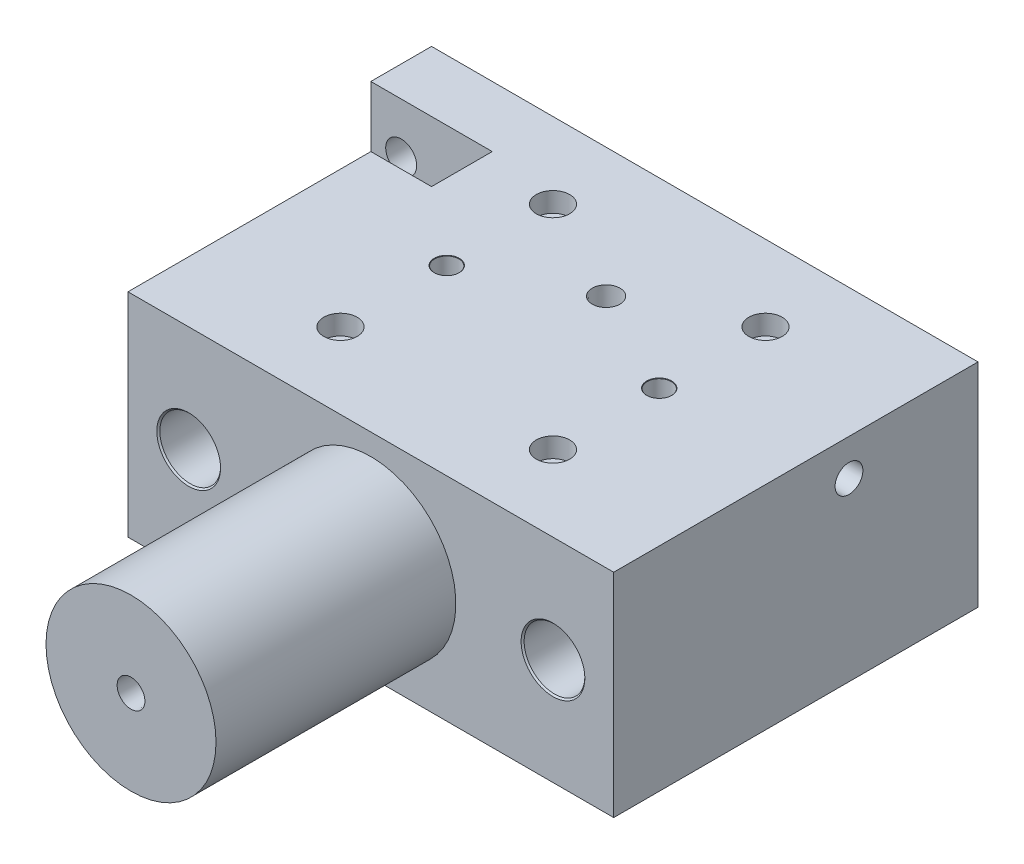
ISO-10303-21;
HEADER;
FILE_DESCRIPTION(('STEP AP214'),'2;1');
FILE_NAME('part.step','',(''),(''),'','','');
FILE_SCHEMA(('AUTOMOTIVE_DESIGN { 1 0 10303 214 1 1 1 1 }'));
ENDSEC;
DATA;
#1=APPLICATION_CONTEXT('core data for automotive mechanical design processes');
#2=APPLICATION_PROTOCOL_DEFINITION('international standard','automotive_design',2000,#1);
#3=PRODUCT_CONTEXT('',#1,'mechanical');
#4=PRODUCT('Part','Part','',(#3));
#5=PRODUCT_RELATED_PRODUCT_CATEGORY('part','',(#4));
#6=PRODUCT_DEFINITION_FORMATION('','',#4);
#7=PRODUCT_DEFINITION_CONTEXT('part definition',#1,'design');
#8=PRODUCT_DEFINITION('design','',#6,#7);
#9=PRODUCT_DEFINITION_SHAPE('','',#8);
#10=(LENGTH_UNIT() NAMED_UNIT(*) SI_UNIT(.MILLI.,.METRE.));
#11=(NAMED_UNIT(*) PLANE_ANGLE_UNIT() SI_UNIT($,.RADIAN.));
#12=(NAMED_UNIT(*) SI_UNIT($,.STERADIAN.) SOLID_ANGLE_UNIT());
#13=UNCERTAINTY_MEASURE_WITH_UNIT(LENGTH_MEASURE(1.E-05),#10,'distance_accuracy_value','');
#14=(GEOMETRIC_REPRESENTATION_CONTEXT(3) GLOBAL_UNCERTAINTY_ASSIGNED_CONTEXT((#13)) GLOBAL_UNIT_ASSIGNED_CONTEXT((#10,
#11,#12)) REPRESENTATION_CONTEXT('',''));
#15=CARTESIAN_POINT('',(0.,0.,0.));
#16=DIRECTION('',(0.,0.,1.));
#17=DIRECTION('',(1.,0.,0.));
#18=AXIS2_PLACEMENT_3D('',#15,#16,#17);
#19=CARTESIAN_POINT('',(0.,4.,-111.));
#20=DIRECTION('',(-1.,0.,0.));
#21=DIRECTION('',(0.,0.,1.));
#22=AXIS2_PLACEMENT_3D('',#19,#20,#21);
#23=CYLINDRICAL_SURFACE('',#22,2.39999999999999);
#24=CARTESIAN_POINT('',(8.99999999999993,4.,-111.));
#25=DIRECTION('',(-1.,0.,0.));
#26=DIRECTION('',(0.,0.,1.));
#27=AXIS2_PLACEMENT_3D('',#24,#25,#26);
#28=CIRCLE('',#27,2.39999999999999);
#29=CARTESIAN_POINT('',(8.99999999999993,4.,-108.6));
#30=VERTEX_POINT('',#29);
#31=EDGE_CURVE('E9355',#30,#30,#28,.T.);
#32=ORIENTED_EDGE('',*,*,#31,.F.);
#33=EDGE_LOOP('',(#32));
#34=FACE_BOUND('',#33,.T.);
#35=CARTESIAN_POINT('',(4.5,4.,-111.));
#36=DIRECTION('',(-1.,0.,0.));
#37=DIRECTION('',(0.,0.,1.));
#38=AXIS2_PLACEMENT_3D('',#35,#36,#37);
#39=CIRCLE('',#38,2.39999999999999);
#40=CARTESIAN_POINT('',(4.5,4.,-108.6));
#41=VERTEX_POINT('',#40);
#42=EDGE_CURVE('E9342',#41,#41,#39,.F.);
#43=ORIENTED_EDGE('',*,*,#42,.F.);
#44=EDGE_LOOP('',(#43));
#45=FACE_BOUND('',#44,.T.);
#46=ADVANCED_FACE('F9174',(#34,#45),#23,.F.);
#47=CARTESIAN_POINT('',(0.,70.,-120.));
#48=DIRECTION('',(1.,0.,0.));
#49=DIRECTION('',(0.,0.,-1.));
#50=AXIS2_PLACEMENT_3D('',#47,#48,#49);
#51=PLANE('',#50);
#52=CARTESIAN_POINT('',(0.,4.,-111.));
#53=DIRECTION('',(-1.,0.,0.));
#54=DIRECTION('',(0.,0.,1.));
#55=AXIS2_PLACEMENT_3D('',#52,#53,#54);
#56=CIRCLE('',#55,4.);
#57=CARTESIAN_POINT('',(0.,3.85832158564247,-107.002509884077));
#58=VERTEX_POINT('',#57);
#59=CARTESIAN_POINT('',(0.,4.,-115.));
#60=VERTEX_POINT('',#59);
#61=EDGE_CURVE('E9321',#58,#60,#56,.T.);
#62=ORIENTED_EDGE('',*,*,#61,.F.);
#63=DIRECTION('',(0.,1.,0.));
#64=VECTOR('',#63,1.);
#65=CARTESIAN_POINT('',(0.,3.85832158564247,-107.002509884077));
#66=LINE('',#65,#64);
#67=CARTESIAN_POINT('',(0.,0.,-107.002509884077));
#68=VERTEX_POINT('',#67);
#69=EDGE_CURVE('E9328',#68,#58,#66,.T.);
#70=ORIENTED_EDGE('',*,*,#69,.F.);
#71=DIRECTION('',(0.,0.,1.));
#72=VECTOR('',#71,1.);
#73=CARTESIAN_POINT('',(0.,0.,-120.));
#74=LINE('',#73,#72);
#75=CARTESIAN_POINT('',(0.,0.,-100.));
#76=VERTEX_POINT('',#75);
#77=EDGE_CURVE('E9548',#68,#76,#74,.T.);
#78=ORIENTED_EDGE('',*,*,#77,.T.);
#79=DIRECTION('',(0.,-1.,0.));
#80=VECTOR('',#79,1.);
#81=CARTESIAN_POINT('',(0.,70.,-100.));
#82=LINE('',#81,#80);
#83=CARTESIAN_POINT('',(0.,70.,-100.));
#84=VERTEX_POINT('',#83);
#85=EDGE_CURVE('E9580',#84,#76,#82,.T.);
#86=ORIENTED_EDGE('',*,*,#85,.F.);
#87=DIRECTION('',(0.,0.,1.));
#88=VECTOR('',#87,1.);
#89=CARTESIAN_POINT('',(0.,70.,-120.));
#90=LINE('',#89,#88);
#91=CARTESIAN_POINT('',(0.,70.,-120.));
#92=VERTEX_POINT('',#91);
#93=EDGE_CURVE('E9565',#92,#84,#90,.T.);
#94=ORIENTED_EDGE('',*,*,#93,.F.);
#95=DIRECTION('',(0.,-1.,0.));
#96=VECTOR('',#95,1.);
#97=CARTESIAN_POINT('',(0.,70.,-120.));
#98=LINE('',#97,#96);
#99=CARTESIAN_POINT('',(0.,0.,-120.));
#100=VERTEX_POINT('',#99);
#101=EDGE_CURVE('E9583',#92,#100,#98,.T.);
#102=ORIENTED_EDGE('',*,*,#101,.T.);
#103=CARTESIAN_POINT('',(0.,0.,-115.));
#104=VERTEX_POINT('',#103);
#105=EDGE_CURVE('E9549',#100,#104,#74,.T.);
#106=ORIENTED_EDGE('',*,*,#105,.T.);
#107=DIRECTION('',(0.,-1.,0.));
#108=VECTOR('',#107,1.);
#109=CARTESIAN_POINT('',(0.,4.,-115.));
#110=LINE('',#109,#108);
#111=EDGE_CURVE('E9326',#60,#104,#110,.T.);
#112=ORIENTED_EDGE('',*,*,#111,.F.);
#113=EDGE_LOOP('',(#62,#70,#78,#86,#94,#102,#106,#112));
#114=FACE_BOUND('',#113,.T.);
#115=ADVANCED_FACE('F9645',(#114),#51,.F.);
#116=CARTESIAN_POINT('',(180.,0.,-120.));
#117=DIRECTION('',(0.,-1.,0.));
#118=DIRECTION('',(0.,0.,-1.));
#119=AXIS2_PLACEMENT_3D('',#116,#117,#118);
#120=PLANE('',#119);
#121=DIRECTION('',(-1.,0.,0.));
#122=VECTOR('',#121,1.);
#123=CARTESIAN_POINT('',(4.5,0.,-107.002509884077));
#124=LINE('',#123,#122);
#125=CARTESIAN_POINT('',(4.5,0.,-107.002509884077));
#126=VERTEX_POINT('',#125);
#127=EDGE_CURVE('E9343',#126,#68,#124,.T.);
#128=ORIENTED_EDGE('',*,*,#127,.F.);
#129=DIRECTION('',(0.,0.,1.));
#130=VECTOR('',#129,1.);
#131=CARTESIAN_POINT('',(4.5,0.,-115.));
#132=LINE('',#131,#130);
#133=CARTESIAN_POINT('',(4.5,0.,-115.));
#134=VERTEX_POINT('',#133);
#135=EDGE_CURVE('E9334',#134,#126,#132,.T.);
#136=ORIENTED_EDGE('',*,*,#135,.F.);
#137=DIRECTION('',(-1.,0.,0.));
#138=VECTOR('',#137,1.);
#139=CARTESIAN_POINT('',(4.5,0.,-115.));
#140=LINE('',#139,#138);
#141=EDGE_CURVE('E9345',#134,#104,#140,.T.);
#142=ORIENTED_EDGE('',*,*,#141,.T.);
#143=ORIENTED_EDGE('',*,*,#105,.F.);
#144=DIRECTION('',(-1.,0.,0.));
#145=VECTOR('',#144,1.);
#146=CARTESIAN_POINT('',(0.,0.,-120.));
#147=LINE('',#146,#145);
#148=CARTESIAN_POINT('',(8.99999999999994,0.,-120.));
#149=VERTEX_POINT('',#148);
#150=EDGE_CURVE('E9544',#149,#100,#147,.T.);
#151=ORIENTED_EDGE('',*,*,#150,.F.);
#152=DIRECTION('',(0.,0.,-1.));
#153=VECTOR('',#152,1.);
#154=CARTESIAN_POINT('',(8.99999999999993,0.,-99.));
#155=LINE('',#154,#153);
#156=CARTESIAN_POINT('',(8.99999999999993,0.,-100.));
#157=VERTEX_POINT('',#156);
#158=EDGE_CURVE('E9358',#157,#149,#155,.T.);
#159=ORIENTED_EDGE('',*,*,#158,.F.);
#160=DIRECTION('',(1.,0.,0.));
#161=VECTOR('',#160,1.);
#162=CARTESIAN_POINT('',(0.,0.,-100.));
#163=LINE('',#162,#161);
#164=EDGE_CURVE('E9553',#76,#157,#163,.T.);
#165=ORIENTED_EDGE('',*,*,#164,.F.);
#166=ORIENTED_EDGE('',*,*,#77,.F.);
#167=EDGE_LOOP('',(#128,#136,#142,#143,#151,#159,#165,#166));
#168=FACE_BOUND('',#167,.T.);
#169=ADVANCED_FACE('F9652',(#168),#120,.T.);
#170=CARTESIAN_POINT('',(20.,70.,0.));
#171=DIRECTION('',(0.,0.,-1.));
#172=DIRECTION('',(-1.,0.,0.));
#173=AXIS2_PLACEMENT_3D('',#170,#171,#172);
#174=PLANE('',#173);
#175=DIRECTION('',(1.,0.,0.));
#176=VECTOR('',#175,1.);
#177=CARTESIAN_POINT('',(20.,0.,0.));
#178=LINE('',#177,#176);
#179=CARTESIAN_POINT('',(20.,0.,0.));
#180=VERTEX_POINT('',#179);
#181=CARTESIAN_POINT('',(180.,0.,0.));
#182=VERTEX_POINT('',#181);
#183=EDGE_CURVE('E9558',#180,#182,#178,.T.);
#184=ORIENTED_EDGE('',*,*,#183,.T.);
#185=DIRECTION('',(0.,-1.,0.));
#186=VECTOR('',#185,1.);
#187=CARTESIAN_POINT('',(180.,70.,0.));
#188=LINE('',#187,#186);
#189=CARTESIAN_POINT('',(180.,70.,0.));
#190=VERTEX_POINT('',#189);
#191=EDGE_CURVE('E9572',#190,#182,#188,.T.);
#192=ORIENTED_EDGE('',*,*,#191,.F.);
#193=DIRECTION('',(1.,0.,0.));
#194=VECTOR('',#193,1.);
#195=CARTESIAN_POINT('',(20.,70.,0.));
#196=LINE('',#195,#194);
#197=CARTESIAN_POINT('',(20.,70.,0.));
#198=VERTEX_POINT('',#197);
#199=EDGE_CURVE('E9570',#198,#190,#196,.T.);
#200=ORIENTED_EDGE('',*,*,#199,.F.);
#201=DIRECTION('',(0.,-1.,0.));
#202=VECTOR('',#201,1.);
#203=CARTESIAN_POINT('',(20.,70.,0.));
#204=LINE('',#203,#202);
#205=EDGE_CURVE('E9575',#198,#180,#204,.T.);
#206=ORIENTED_EDGE('',*,*,#205,.T.);
#207=EDGE_LOOP('',(#184,#192,#200,#206));
#208=FACE_BOUND('',#207,.T.);
#209=CARTESIAN_POINT('',(40.,35.,0.));
#210=DIRECTION('',(0.,0.,1.));
#211=DIRECTION('',(1.,0.,0.));
#212=AXIS2_PLACEMENT_3D('',#209,#210,#211);
#213=CIRCLE('',#212,10.5);
#214=CARTESIAN_POINT('',(50.5,35.,0.));
#215=VERTEX_POINT('',#214);
#216=EDGE_CURVE('E9526',#215,#215,#213,.T.);
#217=ORIENTED_EDGE('',*,*,#216,.F.);
#218=EDGE_LOOP('',(#217));
#219=FACE_BOUND('',#218,.T.);
#220=CARTESIAN_POINT('',(160.,35.,0.));
#221=DIRECTION('',(0.,0.,1.));
#222=DIRECTION('',(1.,0.,0.));
#223=AXIS2_PLACEMENT_3D('',#220,#221,#222);
#224=CIRCLE('',#223,10.5);
#225=CARTESIAN_POINT('',(170.5,35.,0.));
#226=VERTEX_POINT('',#225);
#227=EDGE_CURVE('E9514',#226,#226,#224,.T.);
#228=ORIENTED_EDGE('',*,*,#227,.F.);
#229=EDGE_LOOP('',(#228));
#230=FACE_BOUND('',#229,.T.);
#231=CARTESIAN_POINT('',(100.,35.,0.));
#232=DIRECTION('',(0.,0.,-1.));
#233=DIRECTION('',(-1.,0.,0.));
#234=AXIS2_PLACEMENT_3D('',#231,#232,#233);
#235=CIRCLE('',#234,28.);
#236=CARTESIAN_POINT('',(72.,35.,0.));
#237=VERTEX_POINT('',#236);
#238=EDGE_CURVE('E9589',#237,#237,#235,.F.);
#239=ORIENTED_EDGE('',*,*,#238,.F.);
#240=EDGE_LOOP('',(#239));
#241=FACE_BOUND('',#240,.T.);
#242=ADVANCED_FACE('F9626',(#208,#219,#230,#241),#174,.F.);
#243=DIRECTION('',(0.,0.,1.));
#244=VECTOR('',#243,1.);
#245=CARTESIAN_POINT('',(10.9999999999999,0.,-99.));
#246=LINE('',#245,#244);
#247=CARTESIAN_POINT('',(10.9999999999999,0.,-120.));
#248=VERTEX_POINT('',#247);
#249=CARTESIAN_POINT('',(10.9999999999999,0.,-100.));
#250=VERTEX_POINT('',#249);
#251=EDGE_CURVE('E9360',#248,#250,#246,.T.);
#252=ORIENTED_EDGE('',*,*,#251,.F.);
#253=CARTESIAN_POINT('',(180.,0.,-120.));
#254=VERTEX_POINT('',#253);
#255=EDGE_CURVE('E9545',#254,#248,#147,.T.);
#256=ORIENTED_EDGE('',*,*,#255,.F.);
#257=DIRECTION('',(0.,0.,-1.));
#258=VECTOR('',#257,1.);
#259=CARTESIAN_POINT('',(180.,0.,0.));
#260=LINE('',#259,#258);
#261=EDGE_CURVE('E9541',#182,#254,#260,.T.);
#262=ORIENTED_EDGE('',*,*,#261,.F.);
#263=ORIENTED_EDGE('',*,*,#183,.F.);
#264=DIRECTION('',(0.,0.,1.));
#265=VECTOR('',#264,1.);
#266=CARTESIAN_POINT('',(19.9999999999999,0.,-100.));
#267=LINE('',#266,#265);
#268=CARTESIAN_POINT('',(19.9999999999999,0.,-100.));
#269=VERTEX_POINT('',#268);
#270=EDGE_CURVE('E9556',#269,#180,#267,.T.);
#271=ORIENTED_EDGE('',*,*,#270,.F.);
#272=EDGE_CURVE('E9552',#250,#269,#163,.T.);
#273=ORIENTED_EDGE('',*,*,#272,.F.);
#274=EDGE_LOOP('',(#252,#256,#262,#263,#271,#273));
#275=FACE_BOUND('',#274,.T.);
#276=CARTESIAN_POINT('',(100.,0.,-77.5));
#277=DIRECTION('',(0.,-1.,0.));
#278=DIRECTION('',(0.,0.,-1.));
#279=AXIS2_PLACEMENT_3D('',#276,#277,#278);
#280=CIRCLE('',#279,4.57349999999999);
#281=CARTESIAN_POINT('',(100.,0.,-82.0735));
#282=VERTEX_POINT('',#281);
#283=EDGE_CURVE('E9422',#282,#282,#280,.T.);
#284=ORIENTED_EDGE('',*,*,#283,.F.);
#285=EDGE_LOOP('',(#284));
#286=FACE_BOUND('',#285,.T.);
#287=CARTESIAN_POINT('',(65.,0.,-25.));
#288=DIRECTION('',(0.,-1.,0.));
#289=DIRECTION('',(0.,0.,-1.));
#290=AXIS2_PLACEMENT_3D('',#287,#288,#289);
#291=CIRCLE('',#290,5.50000000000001);
#292=CARTESIAN_POINT('',(65.,0.,-30.5));
#293=VERTEX_POINT('',#292);
#294=EDGE_CURVE('E9428',#293,#293,#291,.T.);
#295=ORIENTED_EDGE('',*,*,#294,.F.);
#296=EDGE_LOOP('',(#295));
#297=FACE_BOUND('',#296,.T.);
#298=CARTESIAN_POINT('',(65.,0.,-95.));
#299=DIRECTION('',(0.,-1.,0.));
#300=DIRECTION('',(0.,0.,-1.));
#301=AXIS2_PLACEMENT_3D('',#298,#299,#300);
#302=CIRCLE('',#301,5.50000000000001);
#303=CARTESIAN_POINT('',(65.,0.,-100.5));
#304=VERTEX_POINT('',#303);
#305=EDGE_CURVE('E9456',#304,#304,#302,.T.);
#306=ORIENTED_EDGE('',*,*,#305,.F.);
#307=EDGE_LOOP('',(#306));
#308=FACE_BOUND('',#307,.T.);
#309=CARTESIAN_POINT('',(135.,0.,-60.));
#310=DIRECTION('',(0.,-1.,0.));
#311=DIRECTION('',(0.,0.,-1.));
#312=AXIS2_PLACEMENT_3D('',#309,#310,#311);
#313=CIRCLE('',#312,4.12499999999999);
#314=CARTESIAN_POINT('',(135.,0.,-64.125));
#315=VERTEX_POINT('',#314);
#316=EDGE_CURVE('E9490',#315,#315,#313,.T.);
#317=ORIENTED_EDGE('',*,*,#316,.F.);
#318=EDGE_LOOP('',(#317));
#319=FACE_BOUND('',#318,.T.);
#320=CARTESIAN_POINT('',(65.,0.,-60.));
#321=DIRECTION('',(0.,-1.,0.));
#322=DIRECTION('',(0.,0.,-1.));
#323=AXIS2_PLACEMENT_3D('',#320,#321,#322);
#324=CIRCLE('',#323,4.125);
#325=CARTESIAN_POINT('',(65.,0.,-64.125));
#326=VERTEX_POINT('',#325);
#327=EDGE_CURVE('E9502',#326,#326,#324,.T.);
#328=ORIENTED_EDGE('',*,*,#327,.F.);
#329=EDGE_LOOP('',(#328));
#330=FACE_BOUND('',#329,.T.);
#331=CARTESIAN_POINT('',(135.,0.,-95.));
#332=DIRECTION('',(0.,-1.,0.));
#333=DIRECTION('',(0.,0.,-1.));
#334=AXIS2_PLACEMENT_3D('',#331,#332,#333);
#335=CIRCLE('',#334,5.50000000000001);
#336=CARTESIAN_POINT('',(135.,0.,-100.5));
#337=VERTEX_POINT('',#336);
#338=EDGE_CURVE('E9470',#337,#337,#335,.T.);
#339=ORIENTED_EDGE('',*,*,#338,.F.);
#340=EDGE_LOOP('',(#339));
#341=FACE_BOUND('',#340,.T.);
#342=CARTESIAN_POINT('',(135.,0.,-25.));
#343=DIRECTION('',(0.,-1.,0.));
#344=DIRECTION('',(0.,0.,-1.));
#345=AXIS2_PLACEMENT_3D('',#342,#343,#344);
#346=CIRCLE('',#345,5.50000000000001);
#347=CARTESIAN_POINT('',(135.,0.,-30.5));
#348=VERTEX_POINT('',#347);
#349=EDGE_CURVE('E9442',#348,#348,#346,.T.);
#350=ORIENTED_EDGE('',*,*,#349,.F.);
#351=EDGE_LOOP('',(#350));
#352=FACE_BOUND('',#351,.T.);
#353=ADVANCED_FACE('F9631',(#275,#286,#297,#308,#319,#330,#341,#352),#120,.T.);
#354=CARTESIAN_POINT('',(180.,70.,0.));
#355=DIRECTION('',(-1.,0.,0.));
#356=DIRECTION('',(0.,0.,1.));
#357=AXIS2_PLACEMENT_3D('',#354,#355,#356);
#358=PLANE('',#357);
#359=CARTESIAN_POINT('',(180.,58.,-77.5));
#360=DIRECTION('',(1.,0.,0.));
#361=DIRECTION('',(0.,0.,-1.));
#362=AXIS2_PLACEMENT_3D('',#359,#360,#361);
#363=CIRCLE('',#362,4.57349999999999);
#364=CARTESIAN_POINT('',(180.,58.,-82.0735));
#365=VERTEX_POINT('',#364);
#366=EDGE_CURVE('E9398',#365,#365,#363,.T.);
#367=ORIENTED_EDGE('',*,*,#366,.F.);
#368=EDGE_LOOP('',(#367));
#369=FACE_BOUND('',#368,.T.);
#370=ORIENTED_EDGE('',*,*,#261,.T.);
#371=DIRECTION('',(0.,-1.,0.));
#372=VECTOR('',#371,1.);
#373=CARTESIAN_POINT('',(180.,70.,-120.));
#374=LINE('',#373,#372);
#375=CARTESIAN_POINT('',(180.,70.,-120.));
#376=VERTEX_POINT('',#375);
#377=EDGE_CURVE('E9586',#376,#254,#374,.T.);
#378=ORIENTED_EDGE('',*,*,#377,.F.);
#379=DIRECTION('',(0.,0.,-1.));
#380=VECTOR('',#379,1.);
#381=CARTESIAN_POINT('',(180.,70.,0.));
#382=LINE('',#381,#380);
#383=EDGE_CURVE('E9560',#190,#376,#382,.T.);
#384=ORIENTED_EDGE('',*,*,#383,.F.);
#385=ORIENTED_EDGE('',*,*,#191,.T.);
#386=EDGE_LOOP('',(#370,#378,#384,#385));
#387=FACE_BOUND('',#386,.T.);
#388=ADVANCED_FACE('F9176',(#369,#387),#358,.F.);
#389=CARTESIAN_POINT('',(0.,70.,-120.));
#390=DIRECTION('',(0.,0.,1.));
#391=DIRECTION('',(1.,0.,0.));
#392=AXIS2_PLACEMENT_3D('',#389,#390,#391);
#393=PLANE('',#392);
#394=CARTESIAN_POINT('',(160.,35.,-120.));
#395=DIRECTION('',(0.,0.,1.));
#396=DIRECTION('',(1.,0.,0.));
#397=AXIS2_PLACEMENT_3D('',#394,#395,#396);
#398=CIRCLE('',#397,10.5);
#399=CARTESIAN_POINT('',(170.5,35.,-120.));
#400=VERTEX_POINT('',#399);
#401=EDGE_CURVE('E9505',#400,#400,#398,.T.);
#402=ORIENTED_EDGE('',*,*,#401,.T.);
#403=EDGE_LOOP('',(#402));
#404=FACE_BOUND('',#403,.T.);
#405=CARTESIAN_POINT('',(40.,35.,-120.));
#406=DIRECTION('',(0.,0.,1.));
#407=DIRECTION('',(1.,0.,0.));
#408=AXIS2_PLACEMENT_3D('',#405,#406,#407);
#409=CIRCLE('',#408,10.5);
#410=CARTESIAN_POINT('',(50.5,35.,-120.));
#411=VERTEX_POINT('',#410);
#412=EDGE_CURVE('E9517',#411,#411,#409,.T.);
#413=ORIENTED_EDGE('',*,*,#412,.T.);
#414=EDGE_LOOP('',(#413));
#415=FACE_BOUND('',#414,.T.);
#416=CARTESIAN_POINT('',(9.99999999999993,53.5,-120.));
#417=DIRECTION('',(0.,0.,1.));
#418=DIRECTION('',(1.,0.,0.));
#419=AXIS2_PLACEMENT_3D('',#416,#417,#418);
#420=CIRCLE('',#419,5.1);
#421=CARTESIAN_POINT('',(15.0999999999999,53.5,-120.));
#422=VERTEX_POINT('',#421);
#423=EDGE_CURVE('E9529',#422,#422,#420,.T.);
#424=ORIENTED_EDGE('',*,*,#423,.T.);
#425=EDGE_LOOP('',(#424));
#426=FACE_BOUND('',#425,.T.);
#427=CARTESIAN_POINT('',(9.99999999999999,13.5,-120.));
#428=DIRECTION('',(0.,0.,1.));
#429=DIRECTION('',(1.,0.,0.));
#430=AXIS2_PLACEMENT_3D('',#427,#428,#429);
#431=CIRCLE('',#430,6.);
#432=CARTESIAN_POINT('',(10.9999999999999,7.58392021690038,-120.));
#433=VERTEX_POINT('',#432);
#434=CARTESIAN_POINT('',(8.99999999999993,7.5839202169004,-120.));
#435=VERTEX_POINT('',#434);
#436=EDGE_CURVE('E9535',#433,#435,#431,.T.);
#437=ORIENTED_EDGE('',*,*,#436,.T.);
#438=DIRECTION('',(0.,-1.,0.));
#439=VECTOR('',#438,1.);
#440=CARTESIAN_POINT('',(8.99999999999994,70.,-120.));
#441=LINE('',#440,#439);
#442=EDGE_CURVE('E9371',#435,#149,#441,.T.);
#443=ORIENTED_EDGE('',*,*,#442,.T.);
#444=ORIENTED_EDGE('',*,*,#150,.T.);
#445=ORIENTED_EDGE('',*,*,#101,.F.);
#446=DIRECTION('',(-1.,0.,0.));
#447=VECTOR('',#446,1.);
#448=CARTESIAN_POINT('',(0.,70.,-120.));
#449=LINE('',#448,#447);
#450=EDGE_CURVE('E9563',#376,#92,#449,.T.);
#451=ORIENTED_EDGE('',*,*,#450,.F.);
#452=ORIENTED_EDGE('',*,*,#377,.T.);
#453=ORIENTED_EDGE('',*,*,#255,.T.);
#454=DIRECTION('',(0.,1.,0.));
#455=VECTOR('',#454,1.);
#456=CARTESIAN_POINT('',(10.9999999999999,70.,-120.));
#457=LINE('',#456,#455);
#458=EDGE_CURVE('E9365',#248,#433,#457,.T.);
#459=ORIENTED_EDGE('',*,*,#458,.T.);
#460=EDGE_LOOP('',(#437,#443,#444,#445,#451,#452,#453,#459));
#461=FACE_BOUND('',#460,.T.);
#462=ADVANCED_FACE('F9640',(#404,#415,#426,#461),#393,.F.);
#463=CARTESIAN_POINT('',(0.,70.,-100.));
#464=DIRECTION('',(0.,0.,-1.));
#465=DIRECTION('',(-1.,0.,0.));
#466=AXIS2_PLACEMENT_3D('',#463,#464,#465);
#467=PLANE('',#466);
#468=CARTESIAN_POINT('',(9.99999999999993,53.5,-100.));
#469=DIRECTION('',(0.,0.,1.));
#470=DIRECTION('',(1.,0.,0.));
#471=AXIS2_PLACEMENT_3D('',#468,#469,#470);
#472=CIRCLE('',#471,5.1);
#473=CARTESIAN_POINT('',(15.0999999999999,53.5,-100.));
#474=VERTEX_POINT('',#473);
#475=EDGE_CURVE('E9532',#474,#474,#472,.T.);
#476=ORIENTED_EDGE('',*,*,#475,.F.);
#477=EDGE_LOOP('',(#476));
#478=FACE_BOUND('',#477,.T.);
#479=DIRECTION('',(0.,-1.,0.));
#480=VECTOR('',#479,1.);
#481=CARTESIAN_POINT('',(19.9999999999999,70.,-100.));
#482=LINE('',#481,#480);
#483=CARTESIAN_POINT('',(19.9999999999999,50.,-100.));
#484=VERTEX_POINT('',#483);
#485=EDGE_CURVE('E9578',#484,#269,#482,.T.);
#486=ORIENTED_EDGE('',*,*,#485,.F.);
#487=DIRECTION('',(-0.707106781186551,-0.707106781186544,0.));
#488=VECTOR('',#487,1.);
#489=CARTESIAN_POINT('',(19.9999999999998,50.,-100.));
#490=LINE('',#489,#488);
#491=CARTESIAN_POINT('',(39.9999999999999,70.,-100.));
#492=VERTEX_POINT('',#491);
#493=EDGE_CURVE('E9182',#484,#492,#490,.F.);
#494=ORIENTED_EDGE('',*,*,#493,.T.);
#495=DIRECTION('',(1.,0.,0.));
#496=VECTOR('',#495,1.);
#497=CARTESIAN_POINT('',(0.,70.,-100.));
#498=LINE('',#497,#496);
#499=EDGE_CURVE('E9311',#84,#492,#498,.T.);
#500=ORIENTED_EDGE('',*,*,#499,.F.);
#501=ORIENTED_EDGE('',*,*,#85,.T.);
#502=ORIENTED_EDGE('',*,*,#164,.T.);
#503=DIRECTION('',(0.,1.,0.));
#504=VECTOR('',#503,1.);
#505=CARTESIAN_POINT('',(8.99999999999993,70.,-100.));
#506=LINE('',#505,#504);
#507=CARTESIAN_POINT('',(8.99999999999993,7.58392021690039,-100.));
#508=VERTEX_POINT('',#507);
#509=EDGE_CURVE('E9368',#157,#508,#506,.T.);
#510=ORIENTED_EDGE('',*,*,#509,.T.);
#511=CARTESIAN_POINT('',(9.99999999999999,13.5,-100.));
#512=DIRECTION('',(0.,0.,1.));
#513=DIRECTION('',(1.,0.,0.));
#514=AXIS2_PLACEMENT_3D('',#511,#512,#513);
#515=CIRCLE('',#514,6.);
#516=CARTESIAN_POINT('',(10.9999999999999,7.58392021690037,-100.));
#517=VERTEX_POINT('',#516);
#518=EDGE_CURVE('E9538',#517,#508,#515,.T.);
#519=ORIENTED_EDGE('',*,*,#518,.F.);
#520=DIRECTION('',(0.,-1.,0.));
#521=VECTOR('',#520,1.);
#522=CARTESIAN_POINT('',(10.9999999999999,70.,-100.));
#523=LINE('',#522,#521);
#524=EDGE_CURVE('E9362',#517,#250,#523,.T.);
#525=ORIENTED_EDGE('',*,*,#524,.T.);
#526=ORIENTED_EDGE('',*,*,#272,.T.);
#527=EDGE_LOOP('',(#486,#494,#500,#501,#502,#510,#519,#525,#526));
#528=FACE_BOUND('',#527,.T.);
#529=ADVANCED_FACE('F9616',(#478,#528),#467,.F.);
#530=CARTESIAN_POINT('',(19.9999999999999,70.,-100.));
#531=DIRECTION('',(1.,0.,0.));
#532=DIRECTION('',(0.,0.,-1.));
#533=AXIS2_PLACEMENT_3D('',#530,#531,#532);
#534=PLANE('',#533);
#535=DIRECTION('',(0.,0.,1.));
#536=VECTOR('',#535,1.);
#537=CARTESIAN_POINT('',(19.9999999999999,70.,-100.));
#538=LINE('',#537,#536);
#539=CARTESIAN_POINT('',(19.9999999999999,70.,-80.));
#540=VERTEX_POINT('',#539);
#541=EDGE_CURVE('E9568',#540,#198,#538,.T.);
#542=ORIENTED_EDGE('',*,*,#541,.F.);
#543=DIRECTION('',(0.,1.,0.));
#544=VECTOR('',#543,1.);
#545=CARTESIAN_POINT('',(19.9999999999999,50.,-80.));
#546=LINE('',#545,#544);
#547=CARTESIAN_POINT('',(19.9999999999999,50.,-80.));
#548=VERTEX_POINT('',#547);
#549=EDGE_CURVE('E9188',#548,#540,#546,.T.);
#550=ORIENTED_EDGE('',*,*,#549,.F.);
#551=DIRECTION('',(0.,0.,1.));
#552=VECTOR('',#551,1.);
#553=CARTESIAN_POINT('',(19.9999999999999,50.,-80.));
#554=LINE('',#553,#552);
#555=EDGE_CURVE('E9313',#484,#548,#554,.T.);
#556=ORIENTED_EDGE('',*,*,#555,.F.);
#557=ORIENTED_EDGE('',*,*,#485,.T.);
#558=ORIENTED_EDGE('',*,*,#270,.T.);
#559=ORIENTED_EDGE('',*,*,#205,.F.);
#560=EDGE_LOOP('',(#542,#550,#556,#557,#558,#559));
#561=FACE_BOUND('',#560,.T.);
#562=ADVANCED_FACE('F9620',(#561),#534,.F.);
#563=CARTESIAN_POINT('',(180.,70.,-120.));
#564=DIRECTION('',(0.,-1.,0.));
#565=DIRECTION('',(0.,0.,-1.));
#566=AXIS2_PLACEMENT_3D('',#563,#564,#565);
#567=PLANE('',#566);
#568=CARTESIAN_POINT('',(100.,70.,-77.5));
#569=DIRECTION('',(0.,1.,0.));
#570=DIRECTION('',(0.,0.,1.));
#571=AXIS2_PLACEMENT_3D('',#568,#569,#570);
#572=CIRCLE('',#571,4.57349999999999);
#573=CARTESIAN_POINT('',(100.,70.,-72.9265));
#574=VERTEX_POINT('',#573);
#575=EDGE_CURVE('E9401',#574,#574,#572,.T.);
#576=ORIENTED_EDGE('',*,*,#575,.F.);
#577=EDGE_LOOP('',(#576));
#578=FACE_BOUND('',#577,.T.);
#579=CARTESIAN_POINT('',(65.,70.,-25.));
#580=DIRECTION('',(0.,1.,0.));
#581=DIRECTION('',(0.,0.,1.));
#582=AXIS2_PLACEMENT_3D('',#579,#580,#581);
#583=CIRCLE('',#582,5.50000000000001);
#584=CARTESIAN_POINT('',(65.,70.,-19.5));
#585=VERTEX_POINT('',#584);
#586=EDGE_CURVE('E9435',#585,#585,#583,.T.);
#587=ORIENTED_EDGE('',*,*,#586,.F.);
#588=EDGE_LOOP('',(#587));
#589=FACE_BOUND('',#588,.T.);
#590=CARTESIAN_POINT('',(135.,70.,-25.));
#591=DIRECTION('',(0.,1.,0.));
#592=DIRECTION('',(0.,0.,1.));
#593=AXIS2_PLACEMENT_3D('',#590,#591,#592);
#594=CIRCLE('',#593,5.50000000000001);
#595=CARTESIAN_POINT('',(135.,70.,-19.5));
#596=VERTEX_POINT('',#595);
#597=EDGE_CURVE('E9449',#596,#596,#594,.T.);
#598=ORIENTED_EDGE('',*,*,#597,.F.);
#599=EDGE_LOOP('',(#598));
#600=FACE_BOUND('',#599,.T.);
#601=CARTESIAN_POINT('',(65.,70.,-95.));
#602=DIRECTION('',(0.,1.,0.));
#603=DIRECTION('',(0.,0.,1.));
#604=AXIS2_PLACEMENT_3D('',#601,#602,#603);
#605=CIRCLE('',#604,5.50000000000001);
#606=CARTESIAN_POINT('',(65.,70.,-89.5));
#607=VERTEX_POINT('',#606);
#608=EDGE_CURVE('E9463',#607,#607,#605,.T.);
#609=ORIENTED_EDGE('',*,*,#608,.F.);
#610=EDGE_LOOP('',(#609));
#611=FACE_BOUND('',#610,.T.);
#612=CARTESIAN_POINT('',(135.,70.,-95.));
#613=DIRECTION('',(0.,1.,0.));
#614=DIRECTION('',(0.,0.,1.));
#615=AXIS2_PLACEMENT_3D('',#612,#613,#614);
#616=CIRCLE('',#615,5.50000000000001);
#617=CARTESIAN_POINT('',(135.,70.,-89.5));
#618=VERTEX_POINT('',#617);
#619=EDGE_CURVE('E9477',#618,#618,#616,.T.);
#620=ORIENTED_EDGE('',*,*,#619,.F.);
#621=EDGE_LOOP('',(#620));
#622=FACE_BOUND('',#621,.T.);
#623=CARTESIAN_POINT('',(135.,70.,-60.));
#624=DIRECTION('',(0.,-1.,0.));
#625=DIRECTION('',(0.,0.,-1.));
#626=AXIS2_PLACEMENT_3D('',#623,#624,#625);
#627=CIRCLE('',#626,4.12499999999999);
#628=CARTESIAN_POINT('',(135.,70.,-64.125));
#629=VERTEX_POINT('',#628);
#630=EDGE_CURVE('E9481',#629,#629,#627,.T.);
#631=ORIENTED_EDGE('',*,*,#630,.T.);
#632=EDGE_LOOP('',(#631));
#633=FACE_BOUND('',#632,.T.);
#634=CARTESIAN_POINT('',(65.,70.,-60.));
#635=DIRECTION('',(0.,-1.,0.));
#636=DIRECTION('',(0.,0.,-1.));
#637=AXIS2_PLACEMENT_3D('',#634,#635,#636);
#638=CIRCLE('',#637,4.12499999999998);
#639=CARTESIAN_POINT('',(65.,70.,-64.125));
#640=VERTEX_POINT('',#639);
#641=EDGE_CURVE('E9493',#640,#640,#638,.T.);
#642=ORIENTED_EDGE('',*,*,#641,.T.);
#643=EDGE_LOOP('',(#642));
#644=FACE_BOUND('',#643,.T.);
#645=ORIENTED_EDGE('',*,*,#499,.T.);
#646=DIRECTION('',(0.,0.,-1.));
#647=VECTOR('',#646,1.);
#648=CARTESIAN_POINT('',(39.9999999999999,70.,-100.));
#649=LINE('',#648,#647);
#650=CARTESIAN_POINT('',(39.9999999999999,70.,-80.));
#651=VERTEX_POINT('',#650);
#652=EDGE_CURVE('E9305',#651,#492,#649,.T.);
#653=ORIENTED_EDGE('',*,*,#652,.F.);
#654=DIRECTION('',(1.,0.,0.));
#655=VECTOR('',#654,1.);
#656=CARTESIAN_POINT('',(39.9999999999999,70.,-80.));
#657=LINE('',#656,#655);
#658=EDGE_CURVE('E9299',#540,#651,#657,.T.);
#659=ORIENTED_EDGE('',*,*,#658,.F.);
#660=ORIENTED_EDGE('',*,*,#541,.T.);
#661=ORIENTED_EDGE('',*,*,#199,.T.);
#662=ORIENTED_EDGE('',*,*,#383,.T.);
#663=ORIENTED_EDGE('',*,*,#450,.T.);
#664=ORIENTED_EDGE('',*,*,#93,.T.);
#665=EDGE_LOOP('',(#645,#653,#659,#660,#661,#662,#663,#664));
#666=FACE_BOUND('',#665,.T.);
#667=ADVANCED_FACE('F9309',(#578,#589,#600,#611,#622,#633,#644,#666),#567,.F.);
#668=CARTESIAN_POINT('',(9.99999999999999,13.5,-100.));
#669=DIRECTION('',(0.,0.,1.));
#670=DIRECTION('',(1.,0.,0.));
#671=AXIS2_PLACEMENT_3D('',#668,#669,#670);
#672=CYLINDRICAL_SURFACE('',#671,6.);
#673=ORIENTED_EDGE('',*,*,#518,.T.);
#674=DIRECTION('',(0.,0.,1.));
#675=VECTOR('',#674,1.);
#676=CARTESIAN_POINT('',(8.99999999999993,7.58392021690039,-100.));
#677=LINE('',#676,#675);
#678=EDGE_CURVE('E9611',#508,#435,#677,.F.);
#679=ORIENTED_EDGE('',*,*,#678,.T.);
#680=ORIENTED_EDGE('',*,*,#436,.F.);
#681=DIRECTION('',(0.,0.,1.));
#682=VECTOR('',#681,1.);
#683=CARTESIAN_POINT('',(10.9999999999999,7.58392021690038,-100.));
#684=LINE('',#683,#682);
#685=EDGE_CURVE('E9608',#433,#517,#684,.T.);
#686=ORIENTED_EDGE('',*,*,#685,.T.);
#687=EDGE_LOOP('',(#673,#679,#680,#686));
#688=FACE_BOUND('',#687,.T.);
#689=ADVANCED_FACE('F9657',(#688),#672,.F.);
#690=CARTESIAN_POINT('',(9.99999999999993,53.5,-100.));
#691=DIRECTION('',(0.,0.,1.));
#692=DIRECTION('',(1.,0.,0.));
#693=AXIS2_PLACEMENT_3D('',#690,#691,#692);
#694=CYLINDRICAL_SURFACE('',#693,5.1);
#695=ORIENTED_EDGE('',*,*,#423,.F.);
#696=EDGE_LOOP('',(#695));
#697=FACE_BOUND('',#696,.T.);
#698=ORIENTED_EDGE('',*,*,#475,.T.);
#699=EDGE_LOOP('',(#698));
#700=FACE_BOUND('',#699,.T.);
#701=ADVANCED_FACE('F9789',(#697,#700),#694,.F.);
#702=CARTESIAN_POINT('',(40.,35.,0.));
#703=DIRECTION('',(0.,0.,1.));
#704=DIRECTION('',(1.,0.,0.));
#705=AXIS2_PLACEMENT_3D('',#702,#703,#704);
#706=CONICAL_SURFACE('',#705,10.5,0.785398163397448);
#707=CARTESIAN_POINT('',(40.,35.,-0.500000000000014));
#708=DIRECTION('',(0.,0.,1.));
#709=DIRECTION('',(1.,0.,0.));
#710=AXIS2_PLACEMENT_3D('',#707,#708,#709);
#711=CIRCLE('',#710,9.99999999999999);
#712=CARTESIAN_POINT('',(50.,35.,-0.500000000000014));
#713=VERTEX_POINT('',#712);
#714=EDGE_CURVE('E9523',#713,#713,#711,.T.);
#715=ORIENTED_EDGE('',*,*,#714,.F.);
#716=EDGE_LOOP('',(#715));
#717=FACE_BOUND('',#716,.T.);
#718=ORIENTED_EDGE('',*,*,#216,.T.);
#719=EDGE_LOOP('',(#718));
#720=FACE_BOUND('',#719,.T.);
#721=ADVANCED_FACE('F10199',(#717,#720),#706,.F.);
#722=CARTESIAN_POINT('',(40.,35.,0.));
#723=DIRECTION('',(0.,0.,1.));
#724=DIRECTION('',(1.,0.,0.));
#725=AXIS2_PLACEMENT_3D('',#722,#723,#724);
#726=CYLINDRICAL_SURFACE('',#725,9.99999999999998);
#727=CARTESIAN_POINT('',(40.,35.,-119.5));
#728=DIRECTION('',(0.,0.,1.));
#729=DIRECTION('',(1.,0.,0.));
#730=AXIS2_PLACEMENT_3D('',#727,#728,#729);
#731=CIRCLE('',#730,9.99999999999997);
#732=CARTESIAN_POINT('',(50.,35.,-119.5));
#733=VERTEX_POINT('',#732);
#734=EDGE_CURVE('E9520',#733,#733,#731,.T.);
#735=ORIENTED_EDGE('',*,*,#734,.F.);
#736=EDGE_LOOP('',(#735));
#737=FACE_BOUND('',#736,.T.);
#738=ORIENTED_EDGE('',*,*,#714,.T.);
#739=EDGE_LOOP('',(#738));
#740=FACE_BOUND('',#739,.T.);
#741=ADVANCED_FACE('F10191',(#737,#740),#726,.F.);
#742=CARTESIAN_POINT('',(40.,35.,-119.5));
#743=DIRECTION('',(0.,0.,-1.));
#744=DIRECTION('',(-1.,0.,0.));
#745=AXIS2_PLACEMENT_3D('',#742,#743,#744);
#746=CONICAL_SURFACE('',#745,9.99999999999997,0.785398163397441);
#747=ORIENTED_EDGE('',*,*,#412,.F.);
#748=EDGE_LOOP('',(#747));
#749=FACE_BOUND('',#748,.T.);
#750=ORIENTED_EDGE('',*,*,#734,.T.);
#751=EDGE_LOOP('',(#750));
#752=FACE_BOUND('',#751,.T.);
#753=ADVANCED_FACE('F10183',(#749,#752),#746,.F.);
#754=CARTESIAN_POINT('',(160.,35.,0.));
#755=DIRECTION('',(0.,0.,1.));
#756=DIRECTION('',(1.,0.,0.));
#757=AXIS2_PLACEMENT_3D('',#754,#755,#756);
#758=CONICAL_SURFACE('',#757,10.5,0.785398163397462);
#759=CARTESIAN_POINT('',(160.,35.,-0.500000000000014));
#760=DIRECTION('',(0.,0.,1.));
#761=DIRECTION('',(1.,0.,0.));
#762=AXIS2_PLACEMENT_3D('',#759,#760,#761);
#763=CIRCLE('',#762,9.99999999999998);
#764=CARTESIAN_POINT('',(170.,35.,-0.500000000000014));
#765=VERTEX_POINT('',#764);
#766=EDGE_CURVE('E9511',#765,#765,#763,.T.);
#767=ORIENTED_EDGE('',*,*,#766,.F.);
#768=EDGE_LOOP('',(#767));
#769=FACE_BOUND('',#768,.T.);
#770=ORIENTED_EDGE('',*,*,#227,.T.);
#771=EDGE_LOOP('',(#770));
#772=FACE_BOUND('',#771,.T.);
#773=ADVANCED_FACE('F10175',(#769,#772),#758,.F.);
#774=CARTESIAN_POINT('',(160.,35.,0.));
#775=DIRECTION('',(0.,0.,1.));
#776=DIRECTION('',(1.,0.,0.));
#777=AXIS2_PLACEMENT_3D('',#774,#775,#776);
#778=CYLINDRICAL_SURFACE('',#777,9.99999999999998);
#779=CARTESIAN_POINT('',(160.,35.,-119.5));
#780=DIRECTION('',(0.,0.,1.));
#781=DIRECTION('',(1.,0.,0.));
#782=AXIS2_PLACEMENT_3D('',#779,#780,#781);
#783=CIRCLE('',#782,9.99999999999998);
#784=CARTESIAN_POINT('',(170.,35.,-119.5));
#785=VERTEX_POINT('',#784);
#786=EDGE_CURVE('E9508',#785,#785,#783,.T.);
#787=ORIENTED_EDGE('',*,*,#786,.F.);
#788=EDGE_LOOP('',(#787));
#789=FACE_BOUND('',#788,.T.);
#790=ORIENTED_EDGE('',*,*,#766,.T.);
#791=EDGE_LOOP('',(#790));
#792=FACE_BOUND('',#791,.T.);
#793=ADVANCED_FACE('F10167',(#789,#792),#778,.F.);
#794=CARTESIAN_POINT('',(160.,35.,-119.5));
#795=DIRECTION('',(0.,0.,-1.));
#796=DIRECTION('',(-1.,0.,0.));
#797=AXIS2_PLACEMENT_3D('',#794,#795,#796);
#798=CONICAL_SURFACE('',#797,9.99999999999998,0.785398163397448);
#799=ORIENTED_EDGE('',*,*,#401,.F.);
#800=EDGE_LOOP('',(#799));
#801=FACE_BOUND('',#800,.T.);
#802=ORIENTED_EDGE('',*,*,#786,.T.);
#803=EDGE_LOOP('',(#802));
#804=FACE_BOUND('',#803,.T.);
#805=ADVANCED_FACE('F10159',(#801,#804),#798,.F.);
#806=CARTESIAN_POINT('',(65.,0.,-60.));
#807=DIRECTION('',(0.,-1.,0.));
#808=DIRECTION('',(0.,0.,-1.));
#809=AXIS2_PLACEMENT_3D('',#806,#807,#808);
#810=CONICAL_SURFACE('',#809,4.125,0.785398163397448);
#811=CARTESIAN_POINT('',(65.,0.125000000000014,-60.));
#812=DIRECTION('',(0.,-1.,0.));
#813=DIRECTION('',(0.,0.,-1.));
#814=AXIS2_PLACEMENT_3D('',#811,#812,#813);
#815=CIRCLE('',#814,3.99999999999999);
#816=CARTESIAN_POINT('',(65.,0.125000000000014,-64.));
#817=VERTEX_POINT('',#816);
#818=EDGE_CURVE('E9499',#817,#817,#815,.T.);
#819=ORIENTED_EDGE('',*,*,#818,.F.);
#820=EDGE_LOOP('',(#819));
#821=FACE_BOUND('',#820,.T.);
#822=ORIENTED_EDGE('',*,*,#327,.T.);
#823=EDGE_LOOP('',(#822));
#824=FACE_BOUND('',#823,.T.);
#825=ADVANCED_FACE('F10151',(#821,#824),#810,.F.);
#826=CARTESIAN_POINT('',(65.,0.,-60.));
#827=DIRECTION('',(0.,-1.,0.));
#828=DIRECTION('',(0.,0.,-1.));
#829=AXIS2_PLACEMENT_3D('',#826,#827,#828);
#830=CYLINDRICAL_SURFACE('',#829,3.99999999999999);
#831=CARTESIAN_POINT('',(65.,69.875,-60.));
#832=DIRECTION('',(0.,-1.,0.));
#833=DIRECTION('',(0.,0.,-1.));
#834=AXIS2_PLACEMENT_3D('',#831,#832,#833);
#835=CIRCLE('',#834,3.99999999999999);
#836=CARTESIAN_POINT('',(65.,69.875,-64.));
#837=VERTEX_POINT('',#836);
#838=EDGE_CURVE('E9496',#837,#837,#835,.T.);
#839=ORIENTED_EDGE('',*,*,#838,.F.);
#840=EDGE_LOOP('',(#839));
#841=FACE_BOUND('',#840,.T.);
#842=ORIENTED_EDGE('',*,*,#818,.T.);
#843=EDGE_LOOP('',(#842));
#844=FACE_BOUND('',#843,.T.);
#845=ADVANCED_FACE('F10143',(#841,#844),#830,.F.);
#846=CARTESIAN_POINT('',(65.,69.875,-60.));
#847=DIRECTION('',(0.,1.,0.));
#848=DIRECTION('',(0.,0.,1.));
#849=AXIS2_PLACEMENT_3D('',#846,#847,#848);
#850=CONICAL_SURFACE('',#849,3.99999999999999,0.785398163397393);
#851=ORIENTED_EDGE('',*,*,#641,.F.);
#852=EDGE_LOOP('',(#851));
#853=FACE_BOUND('',#852,.T.);
#854=ORIENTED_EDGE('',*,*,#838,.T.);
#855=EDGE_LOOP('',(#854));
#856=FACE_BOUND('',#855,.T.);
#857=ADVANCED_FACE('F10135',(#853,#856),#850,.F.);
#858=CARTESIAN_POINT('',(135.,0.,-60.));
#859=DIRECTION('',(0.,-1.,0.));
#860=DIRECTION('',(0.,0.,-1.));
#861=AXIS2_PLACEMENT_3D('',#858,#859,#860);
#862=CONICAL_SURFACE('',#861,4.12499999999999,0.785398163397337);
#863=CARTESIAN_POINT('',(135.,0.125000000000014,-60.));
#864=DIRECTION('',(0.,-1.,0.));
#865=DIRECTION('',(0.,0.,-1.));
#866=AXIS2_PLACEMENT_3D('',#863,#864,#865);
#867=CIRCLE('',#866,4.);
#868=CARTESIAN_POINT('',(135.,0.125000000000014,-64.));
#869=VERTEX_POINT('',#868);
#870=EDGE_CURVE('E9487',#869,#869,#867,.T.);
#871=ORIENTED_EDGE('',*,*,#870,.F.);
#872=EDGE_LOOP('',(#871));
#873=FACE_BOUND('',#872,.T.);
#874=ORIENTED_EDGE('',*,*,#316,.T.);
#875=EDGE_LOOP('',(#874));
#876=FACE_BOUND('',#875,.T.);
#877=ADVANCED_FACE('F10127',(#873,#876),#862,.F.);
#878=CARTESIAN_POINT('',(135.,0.,-60.));
#879=DIRECTION('',(0.,-1.,0.));
#880=DIRECTION('',(0.,0.,-1.));
#881=AXIS2_PLACEMENT_3D('',#878,#879,#880);
#882=CYLINDRICAL_SURFACE('',#881,3.99999999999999);
#883=CARTESIAN_POINT('',(135.,69.875,-60.));
#884=DIRECTION('',(0.,-1.,0.));
#885=DIRECTION('',(0.,0.,-1.));
#886=AXIS2_PLACEMENT_3D('',#883,#884,#885);
#887=CIRCLE('',#886,3.99999999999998);
#888=CARTESIAN_POINT('',(135.,69.875,-64.));
#889=VERTEX_POINT('',#888);
#890=EDGE_CURVE('E9484',#889,#889,#887,.T.);
#891=ORIENTED_EDGE('',*,*,#890,.F.);
#892=EDGE_LOOP('',(#891));
#893=FACE_BOUND('',#892,.T.);
#894=ORIENTED_EDGE('',*,*,#870,.T.);
#895=EDGE_LOOP('',(#894));
#896=FACE_BOUND('',#895,.T.);
#897=ADVANCED_FACE('F10119',(#893,#896),#882,.F.);
#898=CARTESIAN_POINT('',(135.,69.875,-60.));
#899=DIRECTION('',(0.,1.,0.));
#900=DIRECTION('',(0.,0.,1.));
#901=AXIS2_PLACEMENT_3D('',#898,#899,#900);
#902=CONICAL_SURFACE('',#901,3.99999999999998,0.785398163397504);
#903=ORIENTED_EDGE('',*,*,#630,.F.);
#904=EDGE_LOOP('',(#903));
#905=FACE_BOUND('',#904,.T.);
#906=ORIENTED_EDGE('',*,*,#890,.T.);
#907=EDGE_LOOP('',(#906));
#908=FACE_BOUND('',#907,.T.);
#909=ADVANCED_FACE('F10098',(#905,#908),#902,.F.);
#910=CARTESIAN_POINT('',(135.,70.,-95.));
#911=DIRECTION('',(0.,1.,0.));
#912=DIRECTION('',(0.,0.,1.));
#913=AXIS2_PLACEMENT_3D('',#910,#911,#912);
#914=CYLINDRICAL_SURFACE('',#913,3.39999999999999);
#915=CARTESIAN_POINT('',(135.,6.50000000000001,-95.));
#916=DIRECTION('',(0.,1.,0.));
#917=DIRECTION('',(0.,0.,1.));
#918=AXIS2_PLACEMENT_3D('',#915,#916,#917);
#919=CIRCLE('',#918,3.39999999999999);
#920=CARTESIAN_POINT('',(135.,6.50000000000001,-91.6));
#921=VERTEX_POINT('',#920);
#922=EDGE_CURVE('E9473',#921,#921,#919,.F.);
#923=ORIENTED_EDGE('',*,*,#922,.T.);
#924=EDGE_LOOP('',(#923));
#925=FACE_BOUND('',#924,.T.);
#926=CARTESIAN_POINT('',(135.,63.5,-95.));
#927=DIRECTION('',(0.,-1.,0.));
#928=DIRECTION('',(0.,0.,-1.));
#929=AXIS2_PLACEMENT_3D('',#926,#927,#928);
#930=CIRCLE('',#929,3.39999999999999);
#931=CARTESIAN_POINT('',(135.,63.5,-98.4));
#932=VERTEX_POINT('',#931);
#933=EDGE_CURVE('E9480',#932,#932,#930,.F.);
#934=ORIENTED_EDGE('',*,*,#933,.T.);
#935=EDGE_LOOP('',(#934));
#936=FACE_BOUND('',#935,.T.);
#937=ADVANCED_FACE('F10093',(#925,#936),#914,.F.);
#938=CARTESIAN_POINT('',(135.,63.5,-95.));
#939=DIRECTION('',(0.,-1.,0.));
#940=DIRECTION('',(0.,0.,-1.));
#941=AXIS2_PLACEMENT_3D('',#938,#939,#940);
#942=PLANE('',#941);
#943=CARTESIAN_POINT('',(135.,63.5,-95.));
#944=DIRECTION('',(0.,1.,0.));
#945=DIRECTION('',(0.,0.,1.));
#946=AXIS2_PLACEMENT_3D('',#943,#944,#945);
#947=CIRCLE('',#946,5.50000000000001);
#948=CARTESIAN_POINT('',(135.,63.5,-89.5));
#949=VERTEX_POINT('',#948);
#950=EDGE_CURVE('E9474',#949,#949,#947,.T.);
#951=ORIENTED_EDGE('',*,*,#950,.T.);
#952=EDGE_LOOP('',(#951));
#953=FACE_BOUND('',#952,.T.);
#954=ORIENTED_EDGE('',*,*,#933,.F.);
#955=EDGE_LOOP('',(#954));
#956=FACE_BOUND('',#955,.T.);
#957=ADVANCED_FACE('F10097',(#953,#956),#942,.F.);
#958=CARTESIAN_POINT('',(135.,70.,-95.));
#959=DIRECTION('',(0.,1.,0.));
#960=DIRECTION('',(0.,0.,1.));
#961=AXIS2_PLACEMENT_3D('',#958,#959,#960);
#962=CYLINDRICAL_SURFACE('',#961,5.50000000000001);
#963=ORIENTED_EDGE('',*,*,#950,.F.);
#964=EDGE_LOOP('',(#963));
#965=FACE_BOUND('',#964,.T.);
#966=ORIENTED_EDGE('',*,*,#619,.T.);
#967=EDGE_LOOP('',(#966));
#968=FACE_BOUND('',#967,.T.);
#969=ADVANCED_FACE('F10087',(#965,#968),#962,.F.);
#970=CARTESIAN_POINT('',(135.,6.5,-95.));
#971=DIRECTION('',(0.,1.,0.));
#972=DIRECTION('',(0.,0.,1.));
#973=AXIS2_PLACEMENT_3D('',#970,#971,#972);
#974=PLANE('',#973);
#975=CARTESIAN_POINT('',(135.,6.5,-95.));
#976=DIRECTION('',(0.,-1.,0.));
#977=DIRECTION('',(0.,0.,-1.));
#978=AXIS2_PLACEMENT_3D('',#975,#976,#977);
#979=CIRCLE('',#978,5.50000000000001);
#980=CARTESIAN_POINT('',(135.,6.5,-100.5));
#981=VERTEX_POINT('',#980);
#982=EDGE_CURVE('E9467',#981,#981,#979,.T.);
#983=ORIENTED_EDGE('',*,*,#982,.T.);
#984=EDGE_LOOP('',(#983));
#985=FACE_BOUND('',#984,.T.);
#986=ORIENTED_EDGE('',*,*,#922,.F.);
#987=EDGE_LOOP('',(#986));
#988=FACE_BOUND('',#987,.T.);
#989=ADVANCED_FACE('F10079',(#985,#988),#974,.F.);
#990=CARTESIAN_POINT('',(135.,0.,-95.));
#991=DIRECTION('',(0.,-1.,0.));
#992=DIRECTION('',(0.,0.,-1.));
#993=AXIS2_PLACEMENT_3D('',#990,#991,#992);
#994=CYLINDRICAL_SURFACE('',#993,5.50000000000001);
#995=ORIENTED_EDGE('',*,*,#982,.F.);
#996=EDGE_LOOP('',(#995));
#997=FACE_BOUND('',#996,.T.);
#998=ORIENTED_EDGE('',*,*,#338,.T.);
#999=EDGE_LOOP('',(#998));
#1000=FACE_BOUND('',#999,.T.);
#1001=ADVANCED_FACE('F10058',(#997,#1000),#994,.F.);
#1002=CARTESIAN_POINT('',(65.,70.,-95.));
#1003=DIRECTION('',(0.,1.,0.));
#1004=DIRECTION('',(0.,0.,1.));
#1005=AXIS2_PLACEMENT_3D('',#1002,#1003,#1004);
#1006=CYLINDRICAL_SURFACE('',#1005,3.39999999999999);
#1007=CARTESIAN_POINT('',(65.,6.50000000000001,-95.));
#1008=DIRECTION('',(0.,1.,0.));
#1009=DIRECTION('',(0.,0.,1.));
#1010=AXIS2_PLACEMENT_3D('',#1007,#1008,#1009);
#1011=CIRCLE('',#1010,3.39999999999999);
#1012=CARTESIAN_POINT('',(65.,6.50000000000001,-91.6));
#1013=VERTEX_POINT('',#1012);
#1014=EDGE_CURVE('E9459',#1013,#1013,#1011,.F.);
#1015=ORIENTED_EDGE('',*,*,#1014,.T.);
#1016=EDGE_LOOP('',(#1015));
#1017=FACE_BOUND('',#1016,.T.);
#1018=CARTESIAN_POINT('',(65.,63.5,-95.));
#1019=DIRECTION('',(0.,-1.,0.));
#1020=DIRECTION('',(0.,0.,-1.));
#1021=AXIS2_PLACEMENT_3D('',#1018,#1019,#1020);
#1022=CIRCLE('',#1021,3.39999999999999);
#1023=CARTESIAN_POINT('',(65.,63.5,-98.4));
#1024=VERTEX_POINT('',#1023);
#1025=EDGE_CURVE('E9466',#1024,#1024,#1022,.F.);
#1026=ORIENTED_EDGE('',*,*,#1025,.T.);
#1027=EDGE_LOOP('',(#1026));
#1028=FACE_BOUND('',#1027,.T.);
#1029=ADVANCED_FACE('F10053',(#1017,#1028),#1006,.F.);
#1030=CARTESIAN_POINT('',(65.,63.5,-95.));
#1031=DIRECTION('',(0.,-1.,0.));
#1032=DIRECTION('',(0.,0.,-1.));
#1033=AXIS2_PLACEMENT_3D('',#1030,#1031,#1032);
#1034=PLANE('',#1033);
#1035=CARTESIAN_POINT('',(65.,63.5,-95.));
#1036=DIRECTION('',(0.,1.,0.));
#1037=DIRECTION('',(0.,0.,1.));
#1038=AXIS2_PLACEMENT_3D('',#1035,#1036,#1037);
#1039=CIRCLE('',#1038,5.49999999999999);
#1040=CARTESIAN_POINT('',(65.,63.5,-89.5));
#1041=VERTEX_POINT('',#1040);
#1042=EDGE_CURVE('E9460',#1041,#1041,#1039,.T.);
#1043=ORIENTED_EDGE('',*,*,#1042,.T.);
#1044=EDGE_LOOP('',(#1043));
#1045=FACE_BOUND('',#1044,.T.);
#1046=ORIENTED_EDGE('',*,*,#1025,.F.);
#1047=EDGE_LOOP('',(#1046));
#1048=FACE_BOUND('',#1047,.T.);
#1049=ADVANCED_FACE('F10057',(#1045,#1048),#1034,.F.);
#1050=CARTESIAN_POINT('',(65.,70.,-95.));
#1051=DIRECTION('',(0.,1.,0.));
#1052=DIRECTION('',(0.,0.,1.));
#1053=AXIS2_PLACEMENT_3D('',#1050,#1051,#1052);
#1054=CYLINDRICAL_SURFACE('',#1053,5.5);
#1055=ORIENTED_EDGE('',*,*,#1042,.F.);
#1056=EDGE_LOOP('',(#1055));
#1057=FACE_BOUND('',#1056,.T.);
#1058=ORIENTED_EDGE('',*,*,#608,.T.);
#1059=EDGE_LOOP('',(#1058));
#1060=FACE_BOUND('',#1059,.T.);
#1061=ADVANCED_FACE('F10047',(#1057,#1060),#1054,.F.);
#1062=CARTESIAN_POINT('',(65.,6.5,-95.));
#1063=DIRECTION('',(0.,1.,0.));
#1064=DIRECTION('',(0.,0.,1.));
#1065=AXIS2_PLACEMENT_3D('',#1062,#1063,#1064);
#1066=PLANE('',#1065);
#1067=CARTESIAN_POINT('',(65.,6.5,-95.));
#1068=DIRECTION('',(0.,-1.,0.));
#1069=DIRECTION('',(0.,0.,-1.));
#1070=AXIS2_PLACEMENT_3D('',#1067,#1068,#1069);
#1071=CIRCLE('',#1070,5.49999999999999);
#1072=CARTESIAN_POINT('',(65.,6.5,-100.5));
#1073=VERTEX_POINT('',#1072);
#1074=EDGE_CURVE('E9453',#1073,#1073,#1071,.T.);
#1075=ORIENTED_EDGE('',*,*,#1074,.T.);
#1076=EDGE_LOOP('',(#1075));
#1077=FACE_BOUND('',#1076,.T.);
#1078=ORIENTED_EDGE('',*,*,#1014,.F.);
#1079=EDGE_LOOP('',(#1078));
#1080=FACE_BOUND('',#1079,.T.);
#1081=ADVANCED_FACE('F10039',(#1077,#1080),#1066,.F.);
#1082=CARTESIAN_POINT('',(65.,0.,-95.));
#1083=DIRECTION('',(0.,-1.,0.));
#1084=DIRECTION('',(0.,0.,-1.));
#1085=AXIS2_PLACEMENT_3D('',#1082,#1083,#1084);
#1086=CYLINDRICAL_SURFACE('',#1085,5.5);
#1087=ORIENTED_EDGE('',*,*,#1074,.F.);
#1088=EDGE_LOOP('',(#1087));
#1089=FACE_BOUND('',#1088,.T.);
#1090=ORIENTED_EDGE('',*,*,#305,.T.);
#1091=EDGE_LOOP('',(#1090));
#1092=FACE_BOUND('',#1091,.T.);
#1093=ADVANCED_FACE('F10018',(#1089,#1092),#1086,.F.);
#1094=CARTESIAN_POINT('',(135.,70.,-25.));
#1095=DIRECTION('',(0.,1.,0.));
#1096=DIRECTION('',(0.,0.,1.));
#1097=AXIS2_PLACEMENT_3D('',#1094,#1095,#1096);
#1098=CYLINDRICAL_SURFACE('',#1097,3.39999999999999);
#1099=CARTESIAN_POINT('',(135.,6.50000000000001,-25.));
#1100=DIRECTION('',(0.,1.,0.));
#1101=DIRECTION('',(0.,0.,1.));
#1102=AXIS2_PLACEMENT_3D('',#1099,#1100,#1101);
#1103=CIRCLE('',#1102,3.39999999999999);
#1104=CARTESIAN_POINT('',(135.,6.50000000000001,-21.6));
#1105=VERTEX_POINT('',#1104);
#1106=EDGE_CURVE('E9445',#1105,#1105,#1103,.F.);
#1107=ORIENTED_EDGE('',*,*,#1106,.T.);
#1108=EDGE_LOOP('',(#1107));
#1109=FACE_BOUND('',#1108,.T.);
#1110=CARTESIAN_POINT('',(135.,63.5,-25.));
#1111=DIRECTION('',(0.,-1.,0.));
#1112=DIRECTION('',(0.,0.,-1.));
#1113=AXIS2_PLACEMENT_3D('',#1110,#1111,#1112);
#1114=CIRCLE('',#1113,3.39999999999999);
#1115=CARTESIAN_POINT('',(135.,63.5,-28.4));
#1116=VERTEX_POINT('',#1115);
#1117=EDGE_CURVE('E9452',#1116,#1116,#1114,.F.);
#1118=ORIENTED_EDGE('',*,*,#1117,.T.);
#1119=EDGE_LOOP('',(#1118));
#1120=FACE_BOUND('',#1119,.T.);
#1121=ADVANCED_FACE('F10013',(#1109,#1120),#1098,.F.);
#1122=CARTESIAN_POINT('',(135.,63.5,-25.));
#1123=DIRECTION('',(0.,-1.,0.));
#1124=DIRECTION('',(0.,0.,-1.));
#1125=AXIS2_PLACEMENT_3D('',#1122,#1123,#1124);
#1126=PLANE('',#1125);
#1127=CARTESIAN_POINT('',(135.,63.5,-25.));
#1128=DIRECTION('',(0.,1.,0.));
#1129=DIRECTION('',(0.,0.,1.));
#1130=AXIS2_PLACEMENT_3D('',#1127,#1128,#1129);
#1131=CIRCLE('',#1130,5.50000000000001);
#1132=CARTESIAN_POINT('',(135.,63.5,-19.5));
#1133=VERTEX_POINT('',#1132);
#1134=EDGE_CURVE('E9446',#1133,#1133,#1131,.T.);
#1135=ORIENTED_EDGE('',*,*,#1134,.T.);
#1136=EDGE_LOOP('',(#1135));
#1137=FACE_BOUND('',#1136,.T.);
#1138=ORIENTED_EDGE('',*,*,#1117,.F.);
#1139=EDGE_LOOP('',(#1138));
#1140=FACE_BOUND('',#1139,.T.);
#1141=ADVANCED_FACE('F10017',(#1137,#1140),#1126,.F.);
#1142=CARTESIAN_POINT('',(135.,70.,-25.));
#1143=DIRECTION('',(0.,1.,0.));
#1144=DIRECTION('',(0.,0.,1.));
#1145=AXIS2_PLACEMENT_3D('',#1142,#1143,#1144);
#1146=CYLINDRICAL_SURFACE('',#1145,5.50000000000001);
#1147=ORIENTED_EDGE('',*,*,#1134,.F.);
#1148=EDGE_LOOP('',(#1147));
#1149=FACE_BOUND('',#1148,.T.);
#1150=ORIENTED_EDGE('',*,*,#597,.T.);
#1151=EDGE_LOOP('',(#1150));
#1152=FACE_BOUND('',#1151,.T.);
#1153=ADVANCED_FACE('F10007',(#1149,#1152),#1146,.F.);
#1154=CARTESIAN_POINT('',(135.,6.5,-25.));
#1155=DIRECTION('',(0.,1.,0.));
#1156=DIRECTION('',(0.,0.,1.));
#1157=AXIS2_PLACEMENT_3D('',#1154,#1155,#1156);
#1158=PLANE('',#1157);
#1159=CARTESIAN_POINT('',(135.,6.5,-25.));
#1160=DIRECTION('',(0.,-1.,0.));
#1161=DIRECTION('',(0.,0.,-1.));
#1162=AXIS2_PLACEMENT_3D('',#1159,#1160,#1161);
#1163=CIRCLE('',#1162,5.50000000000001);
#1164=CARTESIAN_POINT('',(135.,6.5,-30.5));
#1165=VERTEX_POINT('',#1164);
#1166=EDGE_CURVE('E9439',#1165,#1165,#1163,.T.);
#1167=ORIENTED_EDGE('',*,*,#1166,.T.);
#1168=EDGE_LOOP('',(#1167));
#1169=FACE_BOUND('',#1168,.T.);
#1170=ORIENTED_EDGE('',*,*,#1106,.F.);
#1171=EDGE_LOOP('',(#1170));
#1172=FACE_BOUND('',#1171,.T.);
#1173=ADVANCED_FACE('F9999',(#1169,#1172),#1158,.F.);
#1174=CARTESIAN_POINT('',(135.,0.,-25.));
#1175=DIRECTION('',(0.,-1.,0.));
#1176=DIRECTION('',(0.,0.,-1.));
#1177=AXIS2_PLACEMENT_3D('',#1174,#1175,#1176);
#1178=CYLINDRICAL_SURFACE('',#1177,5.50000000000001);
#1179=ORIENTED_EDGE('',*,*,#1166,.F.);
#1180=EDGE_LOOP('',(#1179));
#1181=FACE_BOUND('',#1180,.T.);
#1182=ORIENTED_EDGE('',*,*,#349,.T.);
#1183=EDGE_LOOP('',(#1182));
#1184=FACE_BOUND('',#1183,.T.);
#1185=ADVANCED_FACE('F9979',(#1181,#1184),#1178,.F.);
#1186=CARTESIAN_POINT('',(65.,70.,-25.));
#1187=DIRECTION('',(0.,1.,0.));
#1188=DIRECTION('',(0.,0.,1.));
#1189=AXIS2_PLACEMENT_3D('',#1186,#1187,#1188);
#1190=CYLINDRICAL_SURFACE('',#1189,3.39999999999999);
#1191=CARTESIAN_POINT('',(65.,6.50000000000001,-25.));
#1192=DIRECTION('',(0.,1.,0.));
#1193=DIRECTION('',(0.,0.,1.));
#1194=AXIS2_PLACEMENT_3D('',#1191,#1192,#1193);
#1195=CIRCLE('',#1194,3.39999999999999);
#1196=CARTESIAN_POINT('',(65.,6.50000000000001,-21.6));
#1197=VERTEX_POINT('',#1196);
#1198=EDGE_CURVE('E9431',#1197,#1197,#1195,.F.);
#1199=ORIENTED_EDGE('',*,*,#1198,.T.);
#1200=EDGE_LOOP('',(#1199));
#1201=FACE_BOUND('',#1200,.T.);
#1202=CARTESIAN_POINT('',(65.,63.5,-25.));
#1203=DIRECTION('',(0.,-1.,0.));
#1204=DIRECTION('',(0.,0.,-1.));
#1205=AXIS2_PLACEMENT_3D('',#1202,#1203,#1204);
#1206=CIRCLE('',#1205,3.39999999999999);
#1207=CARTESIAN_POINT('',(65.,63.5,-28.4));
#1208=VERTEX_POINT('',#1207);
#1209=EDGE_CURVE('E9438',#1208,#1208,#1206,.F.);
#1210=ORIENTED_EDGE('',*,*,#1209,.T.);
#1211=EDGE_LOOP('',(#1210));
#1212=FACE_BOUND('',#1211,.T.);
#1213=ADVANCED_FACE('F9975',(#1201,#1212),#1190,.F.);
#1214=CARTESIAN_POINT('',(65.,63.5,-25.));
#1215=DIRECTION('',(0.,-1.,0.));
#1216=DIRECTION('',(0.,0.,-1.));
#1217=AXIS2_PLACEMENT_3D('',#1214,#1215,#1216);
#1218=PLANE('',#1217);
#1219=CARTESIAN_POINT('',(65.,63.5,-25.));
#1220=DIRECTION('',(0.,1.,0.));
#1221=DIRECTION('',(0.,0.,1.));
#1222=AXIS2_PLACEMENT_3D('',#1219,#1220,#1221);
#1223=CIRCLE('',#1222,5.49999999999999);
#1224=CARTESIAN_POINT('',(65.,63.5,-19.5));
#1225=VERTEX_POINT('',#1224);
#1226=EDGE_CURVE('E9432',#1225,#1225,#1223,.T.);
#1227=ORIENTED_EDGE('',*,*,#1226,.T.);
#1228=EDGE_LOOP('',(#1227));
#1229=FACE_BOUND('',#1228,.T.);
#1230=ORIENTED_EDGE('',*,*,#1209,.F.);
#1231=EDGE_LOOP('',(#1230));
#1232=FACE_BOUND('',#1231,.T.);
#1233=ADVANCED_FACE('F9978',(#1229,#1232),#1218,.F.);
#1234=CARTESIAN_POINT('',(65.,70.,-25.));
#1235=DIRECTION('',(0.,1.,0.));
#1236=DIRECTION('',(0.,0.,1.));
#1237=AXIS2_PLACEMENT_3D('',#1234,#1235,#1236);
#1238=CYLINDRICAL_SURFACE('',#1237,5.5);
#1239=ORIENTED_EDGE('',*,*,#1226,.F.);
#1240=EDGE_LOOP('',(#1239));
#1241=FACE_BOUND('',#1240,.T.);
#1242=ORIENTED_EDGE('',*,*,#586,.T.);
#1243=EDGE_LOOP('',(#1242));
#1244=FACE_BOUND('',#1243,.T.);
#1245=ADVANCED_FACE('F9969',(#1241,#1244),#1238,.F.);
#1246=CARTESIAN_POINT('',(65.,6.5,-25.));
#1247=DIRECTION('',(0.,1.,0.));
#1248=DIRECTION('',(0.,0.,1.));
#1249=AXIS2_PLACEMENT_3D('',#1246,#1247,#1248);
#1250=PLANE('',#1249);
#1251=CARTESIAN_POINT('',(65.,6.5,-25.));
#1252=DIRECTION('',(0.,-1.,0.));
#1253=DIRECTION('',(0.,0.,-1.));
#1254=AXIS2_PLACEMENT_3D('',#1251,#1252,#1253);
#1255=CIRCLE('',#1254,5.49999999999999);
#1256=CARTESIAN_POINT('',(65.,6.5,-30.5));
#1257=VERTEX_POINT('',#1256);
#1258=EDGE_CURVE('E9425',#1257,#1257,#1255,.T.);
#1259=ORIENTED_EDGE('',*,*,#1258,.T.);
#1260=EDGE_LOOP('',(#1259));
#1261=FACE_BOUND('',#1260,.T.);
#1262=ORIENTED_EDGE('',*,*,#1198,.F.);
#1263=EDGE_LOOP('',(#1262));
#1264=FACE_BOUND('',#1263,.T.);
#1265=ADVANCED_FACE('F9961',(#1261,#1264),#1250,.F.);
#1266=CARTESIAN_POINT('',(65.,0.,-25.));
#1267=DIRECTION('',(0.,-1.,0.));
#1268=DIRECTION('',(0.,0.,-1.));
#1269=AXIS2_PLACEMENT_3D('',#1266,#1267,#1268);
#1270=CYLINDRICAL_SURFACE('',#1269,5.5);
#1271=ORIENTED_EDGE('',*,*,#1258,.F.);
#1272=EDGE_LOOP('',(#1271));
#1273=FACE_BOUND('',#1272,.T.);
#1274=ORIENTED_EDGE('',*,*,#294,.T.);
#1275=EDGE_LOOP('',(#1274));
#1276=FACE_BOUND('',#1275,.T.);
#1277=ADVANCED_FACE('F9953',(#1273,#1276),#1270,.F.);
#1278=CARTESIAN_POINT('',(100.,0.,-77.5));
#1279=DIRECTION('',(0.,-1.,0.));
#1280=DIRECTION('',(0.,0.,-1.));
#1281=AXIS2_PLACEMENT_3D('',#1278,#1279,#1280);
#1282=CONICAL_SURFACE('',#1281,4.57349999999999,0.0312064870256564);
#1283=CARTESIAN_POINT('',(100.,7.4,-77.5));
#1284=DIRECTION('',(0.,-1.,0.));
#1285=DIRECTION('',(0.,0.,-1.));
#1286=AXIS2_PLACEMENT_3D('',#1283,#1284,#1285);
#1287=CIRCLE('',#1286,4.34249700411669);
#1288=CARTESIAN_POINT('',(100.,7.4,-81.8424970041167));
#1289=VERTEX_POINT('',#1288);
#1290=EDGE_CURVE('E9419',#1289,#1289,#1287,.T.);
#1291=ORIENTED_EDGE('',*,*,#1290,.F.);
#1292=EDGE_LOOP('',(#1291));
#1293=FACE_BOUND('',#1292,.T.);
#1294=ORIENTED_EDGE('',*,*,#283,.T.);
#1295=EDGE_LOOP('',(#1294));
#1296=FACE_BOUND('',#1295,.T.);
#1297=ADVANCED_FACE('F9945',(#1293,#1296),#1282,.F.);
#1298=CARTESIAN_POINT('',(103.95,7.4,-77.5));
#1299=DIRECTION('',(0.,1.,0.));
#1300=DIRECTION('',(0.,0.,1.));
#1301=AXIS2_PLACEMENT_3D('',#1298,#1299,#1300);
#1302=PLANE('',#1301);
#1303=CARTESIAN_POINT('',(100.,7.4,-77.5));
#1304=DIRECTION('',(0.,-1.,0.));
#1305=DIRECTION('',(0.,0.,-1.));
#1306=AXIS2_PLACEMENT_3D('',#1303,#1304,#1305);
#1307=CIRCLE('',#1306,3.95000000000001);
#1308=CARTESIAN_POINT('',(100.,7.4,-81.45));
#1309=VERTEX_POINT('',#1308);
#1310=EDGE_CURVE('E9416',#1309,#1309,#1307,.T.);
#1311=ORIENTED_EDGE('',*,*,#1310,.F.);
#1312=EDGE_LOOP('',(#1311));
#1313=FACE_BOUND('',#1312,.T.);
#1314=ORIENTED_EDGE('',*,*,#1290,.T.);
#1315=EDGE_LOOP('',(#1314));
#1316=FACE_BOUND('',#1315,.T.);
#1317=ADVANCED_FACE('F9937',(#1313,#1316),#1302,.F.);
#1318=CARTESIAN_POINT('',(100.,0.,-77.5));
#1319=DIRECTION('',(0.,-1.,0.));
#1320=DIRECTION('',(0.,0.,-1.));
#1321=AXIS2_PLACEMENT_3D('',#1318,#1319,#1320);
#1322=CYLINDRICAL_SURFACE('',#1321,3.95000000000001);
#1323=CARTESIAN_POINT('',(100.,11.935,-77.5));
#1324=DIRECTION('',(0.,-1.,0.));
#1325=DIRECTION('',(0.,0.,-1.));
#1326=AXIS2_PLACEMENT_3D('',#1323,#1324,#1325);
#1327=CIRCLE('',#1326,3.95000000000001);
#1328=CARTESIAN_POINT('',(100.,11.935,-81.45));
#1329=VERTEX_POINT('',#1328);
#1330=EDGE_CURVE('E9413',#1329,#1329,#1327,.T.);
#1331=ORIENTED_EDGE('',*,*,#1330,.F.);
#1332=EDGE_LOOP('',(#1331));
#1333=FACE_BOUND('',#1332,.T.);
#1334=ORIENTED_EDGE('',*,*,#1310,.T.);
#1335=EDGE_LOOP('',(#1334));
#1336=FACE_BOUND('',#1335,.T.);
#1337=ADVANCED_FACE('F9929',(#1333,#1336),#1322,.F.);
#1338=CARTESIAN_POINT('',(100.,11.935,-77.5));
#1339=DIRECTION('',(0.,-1.,0.));
#1340=DIRECTION('',(0.,0.,-1.));
#1341=AXIS2_PLACEMENT_3D('',#1338,#1339,#1340);
#1342=CONICAL_SURFACE('',#1341,3.95000000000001,1.02974425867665);
#1343=CARTESIAN_POINT('',(100.,14.3083994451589,-77.5));
#1344=VERTEX_POINT('',#1343);
#1345=VERTEX_LOOP('',#1344);
#1346=FACE_BOUND('',#1345,.T.);
#1347=ORIENTED_EDGE('',*,*,#1330,.T.);
#1348=EDGE_LOOP('',(#1347));
#1349=FACE_BOUND('',#1348,.T.);
#1350=ADVANCED_FACE('F9921',(#1346,#1349),#1342,.F.);
#1351=CARTESIAN_POINT('',(100.,58.065,-77.5));
#1352=DIRECTION('',(0.,1.,0.));
#1353=DIRECTION('',(0.,0.,1.));
#1354=AXIS2_PLACEMENT_3D('',#1351,#1352,#1353);
#1355=CONICAL_SURFACE('',#1354,3.95000000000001,1.02974425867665);
#1356=CARTESIAN_POINT('',(100.,55.6916005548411,-77.5));
#1357=VERTEX_POINT('',#1356);
#1358=VERTEX_LOOP('',#1357);
#1359=FACE_BOUND('',#1358,.T.);
#1360=CARTESIAN_POINT('',(100.,58.065,-77.5));
#1361=DIRECTION('',(0.,1.,0.));
#1362=DIRECTION('',(0.,0.,1.));
#1363=AXIS2_PLACEMENT_3D('',#1360,#1361,#1362);
#1364=CIRCLE('',#1363,3.95000000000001);
#1365=CARTESIAN_POINT('',(100.,58.065,-73.55));
#1366=VERTEX_POINT('',#1365);
#1367=EDGE_CURVE('E9410',#1366,#1366,#1364,.T.);
#1368=ORIENTED_EDGE('',*,*,#1367,.T.);
#1369=EDGE_LOOP('',(#1368));
#1370=FACE_BOUND('',#1369,.T.);
#1371=ADVANCED_FACE('F9913',(#1359,#1370),#1355,.F.);
#1372=CARTESIAN_POINT('',(100.,70.,-77.5));
#1373=DIRECTION('',(0.,1.,0.));
#1374=DIRECTION('',(0.,0.,1.));
#1375=AXIS2_PLACEMENT_3D('',#1372,#1373,#1374);
#1376=CYLINDRICAL_SURFACE('',#1375,3.95);
#1377=ORIENTED_EDGE('',*,*,#1367,.F.);
#1378=EDGE_LOOP('',(#1377));
#1379=FACE_BOUND('',#1378,.T.);
#1380=CARTESIAN_POINT('',(100.,62.6,-77.5));
#1381=DIRECTION('',(0.,1.,0.));
#1382=DIRECTION('',(0.,0.,1.));
#1383=AXIS2_PLACEMENT_3D('',#1380,#1381,#1382);
#1384=CIRCLE('',#1383,3.95);
#1385=CARTESIAN_POINT('',(100.,62.6,-73.55));
#1386=VERTEX_POINT('',#1385);
#1387=EDGE_CURVE('E9407',#1386,#1386,#1384,.T.);
#1388=ORIENTED_EDGE('',*,*,#1387,.T.);
#1389=EDGE_LOOP('',(#1388));
#1390=FACE_BOUND('',#1389,.T.);
#1391=ADVANCED_FACE('F9905',(#1379,#1390),#1376,.F.);
#1392=CARTESIAN_POINT('',(103.95,62.6,-77.5));
#1393=DIRECTION('',(0.,-1.,0.));
#1394=DIRECTION('',(0.,0.,-1.));
#1395=AXIS2_PLACEMENT_3D('',#1392,#1393,#1394);
#1396=PLANE('',#1395);
#1397=ORIENTED_EDGE('',*,*,#1387,.F.);
#1398=EDGE_LOOP('',(#1397));
#1399=FACE_BOUND('',#1398,.T.);
#1400=CARTESIAN_POINT('',(100.,62.6,-77.5));
#1401=DIRECTION('',(0.,1.,0.));
#1402=DIRECTION('',(0.,0.,1.));
#1403=AXIS2_PLACEMENT_3D('',#1400,#1401,#1402);
#1404=CIRCLE('',#1403,4.34249700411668);
#1405=CARTESIAN_POINT('',(100.,62.6,-73.1575029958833));
#1406=VERTEX_POINT('',#1405);
#1407=EDGE_CURVE('E9404',#1406,#1406,#1404,.T.);
#1408=ORIENTED_EDGE('',*,*,#1407,.T.);
#1409=EDGE_LOOP('',(#1408));
#1410=FACE_BOUND('',#1409,.T.);
#1411=ADVANCED_FACE('F9897',(#1399,#1410),#1396,.F.);
#1412=CARTESIAN_POINT('',(100.,70.,-77.5));
#1413=DIRECTION('',(0.,1.,0.));
#1414=DIRECTION('',(0.,0.,1.));
#1415=AXIS2_PLACEMENT_3D('',#1412,#1413,#1414);
#1416=CONICAL_SURFACE('',#1415,4.57349999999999,0.0312064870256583);
#1417=ORIENTED_EDGE('',*,*,#1407,.F.);
#1418=EDGE_LOOP('',(#1417));
#1419=FACE_BOUND('',#1418,.T.);
#1420=ORIENTED_EDGE('',*,*,#575,.T.);
#1421=EDGE_LOOP('',(#1420));
#1422=FACE_BOUND('',#1421,.T.);
#1423=ADVANCED_FACE('F9884',(#1419,#1422),#1416,.F.);
#1424=CARTESIAN_POINT('',(180.,58.,-77.5));
#1425=DIRECTION('',(1.,0.,0.));
#1426=DIRECTION('',(0.,0.,-1.));
#1427=AXIS2_PLACEMENT_3D('',#1424,#1425,#1426);
#1428=CONICAL_SURFACE('',#1427,4.57349999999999,0.0312064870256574);
#1429=CARTESIAN_POINT('',(172.6,58.,-77.5));
#1430=DIRECTION('',(1.,0.,0.));
#1431=DIRECTION('',(0.,0.,-1.));
#1432=AXIS2_PLACEMENT_3D('',#1429,#1430,#1431);
#1433=CIRCLE('',#1432,4.34249700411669);
#1434=CARTESIAN_POINT('',(172.6,58.,-81.8424970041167));
#1435=VERTEX_POINT('',#1434);
#1436=EDGE_CURVE('E9395',#1435,#1435,#1433,.T.);
#1437=ORIENTED_EDGE('',*,*,#1436,.F.);
#1438=EDGE_LOOP('',(#1437));
#1439=FACE_BOUND('',#1438,.T.);
#1440=ORIENTED_EDGE('',*,*,#366,.T.);
#1441=EDGE_LOOP('',(#1440));
#1442=FACE_BOUND('',#1441,.T.);
#1443=ADVANCED_FACE('F9876',(#1439,#1442),#1428,.F.);
#1444=CARTESIAN_POINT('',(172.6,61.95,-77.5));
#1445=DIRECTION('',(-1.,0.,0.));
#1446=DIRECTION('',(0.,0.,1.));
#1447=AXIS2_PLACEMENT_3D('',#1444,#1445,#1446);
#1448=PLANE('',#1447);
#1449=CARTESIAN_POINT('',(172.6,58.,-77.5));
#1450=DIRECTION('',(1.,0.,0.));
#1451=DIRECTION('',(0.,0.,-1.));
#1452=AXIS2_PLACEMENT_3D('',#1449,#1450,#1451);
#1453=CIRCLE('',#1452,3.95000000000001);
#1454=CARTESIAN_POINT('',(172.6,58.,-81.45));
#1455=VERTEX_POINT('',#1454);
#1456=EDGE_CURVE('E9392',#1455,#1455,#1453,.T.);
#1457=ORIENTED_EDGE('',*,*,#1456,.F.);
#1458=EDGE_LOOP('',(#1457));
#1459=FACE_BOUND('',#1458,.T.);
#1460=ORIENTED_EDGE('',*,*,#1436,.T.);
#1461=EDGE_LOOP('',(#1460));
#1462=FACE_BOUND('',#1461,.T.);
#1463=ADVANCED_FACE('F9868',(#1459,#1462),#1448,.F.);
#1464=CARTESIAN_POINT('',(180.,58.,-77.5));
#1465=DIRECTION('',(1.,0.,0.));
#1466=DIRECTION('',(0.,0.,-1.));
#1467=AXIS2_PLACEMENT_3D('',#1464,#1465,#1466);
#1468=CYLINDRICAL_SURFACE('',#1467,3.95000000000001);
#1469=CARTESIAN_POINT('',(168.065,58.,-77.5));
#1470=DIRECTION('',(1.,0.,0.));
#1471=DIRECTION('',(0.,0.,-1.));
#1472=AXIS2_PLACEMENT_3D('',#1469,#1470,#1471);
#1473=CIRCLE('',#1472,3.95000000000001);
#1474=CARTESIAN_POINT('',(168.065,58.,-81.45));
#1475=VERTEX_POINT('',#1474);
#1476=EDGE_CURVE('E9389',#1475,#1475,#1473,.T.);
#1477=ORIENTED_EDGE('',*,*,#1476,.F.);
#1478=EDGE_LOOP('',(#1477));
#1479=FACE_BOUND('',#1478,.T.);
#1480=ORIENTED_EDGE('',*,*,#1456,.T.);
#1481=EDGE_LOOP('',(#1480));
#1482=FACE_BOUND('',#1481,.T.);
#1483=ADVANCED_FACE('F9860',(#1479,#1482),#1468,.F.);
#1484=CARTESIAN_POINT('',(168.065,58.,-77.5));
#1485=DIRECTION('',(1.,0.,0.));
#1486=DIRECTION('',(0.,0.,-1.));
#1487=AXIS2_PLACEMENT_3D('',#1484,#1485,#1486);
#1488=CONICAL_SURFACE('',#1487,3.95000000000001,1.02974425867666);
#1489=CARTESIAN_POINT('',(165.691600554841,58.,-77.5));
#1490=VERTEX_POINT('',#1489);
#1491=VERTEX_LOOP('',#1490);
#1492=FACE_BOUND('',#1491,.T.);
#1493=ORIENTED_EDGE('',*,*,#1476,.T.);
#1494=EDGE_LOOP('',(#1493));
#1495=FACE_BOUND('',#1494,.T.);
#1496=ADVANCED_FACE('F9846',(#1492,#1495),#1488,.F.);
#1497=CARTESIAN_POINT('',(100.,35.,79.));
#1498=DIRECTION('',(0.,0.,-1.));
#1499=DIRECTION('',(-1.,0.,0.));
#1500=AXIS2_PLACEMENT_3D('',#1497,#1498,#1499);
#1501=CYLINDRICAL_SURFACE('',#1500,28.);
#1502=CARTESIAN_POINT('',(100.,35.,79.));
#1503=DIRECTION('',(0.,0.,1.));
#1504=DIRECTION('',(1.,0.,0.));
#1505=AXIS2_PLACEMENT_3D('',#1502,#1503,#1504);
#1506=CIRCLE('',#1505,28.);
#1507=CARTESIAN_POINT('',(128.,35.,79.));
#1508=VERTEX_POINT('',#1507);
#1509=EDGE_CURVE('E9386',#1508,#1508,#1506,.T.);
#1510=ORIENTED_EDGE('',*,*,#1509,.F.);
#1511=EDGE_LOOP('',(#1510));
#1512=FACE_BOUND('',#1511,.T.);
#1513=ORIENTED_EDGE('',*,*,#238,.T.);
#1514=EDGE_LOOP('',(#1513));
#1515=FACE_BOUND('',#1514,.T.);
#1516=ADVANCED_FACE('F9838',(#1512,#1515),#1501,.T.);
#1517=CARTESIAN_POINT('',(100.,35.,79.));
#1518=DIRECTION('',(0.,0.,1.));
#1519=DIRECTION('',(1.,0.,0.));
#1520=AXIS2_PLACEMENT_3D('',#1517,#1518,#1519);
#1521=PLANE('',#1520);
#1522=CARTESIAN_POINT('',(100.,35.,79.));
#1523=DIRECTION('',(0.,0.,1.));
#1524=DIRECTION('',(1.,0.,0.));
#1525=AXIS2_PLACEMENT_3D('',#1522,#1523,#1524);
#1526=CIRCLE('',#1525,4.57349999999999);
#1527=CARTESIAN_POINT('',(104.5735,35.,79.));
#1528=VERTEX_POINT('',#1527);
#1529=EDGE_CURVE('E9374',#1528,#1528,#1526,.T.);
#1530=ORIENTED_EDGE('',*,*,#1529,.F.);
#1531=EDGE_LOOP('',(#1530));
#1532=FACE_BOUND('',#1531,.T.);
#1533=ORIENTED_EDGE('',*,*,#1509,.T.);
#1534=EDGE_LOOP('',(#1533));
#1535=FACE_BOUND('',#1534,.T.);
#1536=ADVANCED_FACE('F9830',(#1532,#1535),#1521,.T.);
#1537=CARTESIAN_POINT('',(100.,35.,67.065));
#1538=DIRECTION('',(0.,0.,1.));
#1539=DIRECTION('',(1.,0.,0.));
#1540=AXIS2_PLACEMENT_3D('',#1537,#1538,#1539);
#1541=CONICAL_SURFACE('',#1540,3.95,1.02974425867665);
#1542=CARTESIAN_POINT('',(100.,35.,64.6916005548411));
#1543=VERTEX_POINT('',#1542);
#1544=VERTEX_LOOP('',#1543);
#1545=FACE_BOUND('',#1544,.T.);
#1546=CARTESIAN_POINT('',(100.,35.,67.065));
#1547=DIRECTION('',(0.,0.,1.));
#1548=DIRECTION('',(1.,0.,0.));
#1549=AXIS2_PLACEMENT_3D('',#1546,#1547,#1548);
#1550=CIRCLE('',#1549,3.95);
#1551=CARTESIAN_POINT('',(103.95,35.,67.065));
#1552=VERTEX_POINT('',#1551);
#1553=EDGE_CURVE('E9383',#1552,#1552,#1550,.T.);
#1554=ORIENTED_EDGE('',*,*,#1553,.T.);
#1555=EDGE_LOOP('',(#1554));
#1556=FACE_BOUND('',#1555,.T.);
#1557=ADVANCED_FACE('F9822',(#1545,#1556),#1541,.F.);
#1558=CARTESIAN_POINT('',(100.,35.,79.));
#1559=DIRECTION('',(0.,0.,1.));
#1560=DIRECTION('',(1.,0.,0.));
#1561=AXIS2_PLACEMENT_3D('',#1558,#1559,#1560);
#1562=CYLINDRICAL_SURFACE('',#1561,3.95);
#1563=ORIENTED_EDGE('',*,*,#1553,.F.);
#1564=EDGE_LOOP('',(#1563));
#1565=FACE_BOUND('',#1564,.T.);
#1566=CARTESIAN_POINT('',(100.,35.,71.6));
#1567=DIRECTION('',(0.,0.,1.));
#1568=DIRECTION('',(1.,0.,0.));
#1569=AXIS2_PLACEMENT_3D('',#1566,#1567,#1568);
#1570=CIRCLE('',#1569,3.95);
#1571=CARTESIAN_POINT('',(103.95,35.,71.6));
#1572=VERTEX_POINT('',#1571);
#1573=EDGE_CURVE('E9380',#1572,#1572,#1570,.T.);
#1574=ORIENTED_EDGE('',*,*,#1573,.T.);
#1575=EDGE_LOOP('',(#1574));
#1576=FACE_BOUND('',#1575,.T.);
#1577=ADVANCED_FACE('F9814',(#1565,#1576),#1562,.F.);
#1578=CARTESIAN_POINT('',(103.95,35.,71.6));
#1579=DIRECTION('',(0.,0.,-1.));
#1580=DIRECTION('',(-1.,0.,0.));
#1581=AXIS2_PLACEMENT_3D('',#1578,#1579,#1580);
#1582=PLANE('',#1581);
#1583=ORIENTED_EDGE('',*,*,#1573,.F.);
#1584=EDGE_LOOP('',(#1583));
#1585=FACE_BOUND('',#1584,.T.);
#1586=CARTESIAN_POINT('',(100.,35.,71.6));
#1587=DIRECTION('',(0.,0.,1.));
#1588=DIRECTION('',(1.,0.,0.));
#1589=AXIS2_PLACEMENT_3D('',#1586,#1587,#1588);
#1590=CIRCLE('',#1589,4.34249700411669);
#1591=CARTESIAN_POINT('',(104.342497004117,35.,71.6));
#1592=VERTEX_POINT('',#1591);
#1593=EDGE_CURVE('E9377',#1592,#1592,#1590,.T.);
#1594=ORIENTED_EDGE('',*,*,#1593,.T.);
#1595=EDGE_LOOP('',(#1594));
#1596=FACE_BOUND('',#1595,.T.);
#1597=ADVANCED_FACE('F9673',(#1585,#1596),#1582,.F.);
#1598=CARTESIAN_POINT('',(100.,35.,79.));
#1599=DIRECTION('',(0.,0.,1.));
#1600=DIRECTION('',(1.,0.,0.));
#1601=AXIS2_PLACEMENT_3D('',#1598,#1599,#1600);
#1602=CONICAL_SURFACE('',#1601,4.57349999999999,0.0312064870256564);
#1603=ORIENTED_EDGE('',*,*,#1593,.F.);
#1604=EDGE_LOOP('',(#1603));
#1605=FACE_BOUND('',#1604,.T.);
#1606=ORIENTED_EDGE('',*,*,#1529,.T.);
#1607=EDGE_LOOP('',(#1606));
#1608=FACE_BOUND('',#1607,.T.);
#1609=ADVANCED_FACE('F9662',(#1605,#1608),#1602,.F.);
#1610=CARTESIAN_POINT('',(10.9999999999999,13.5,-99.));
#1611=DIRECTION('',(1.,0.,0.));
#1612=DIRECTION('',(0.,0.,-1.));
#1613=AXIS2_PLACEMENT_3D('',#1610,#1611,#1612);
#1614=PLANE('',#1613);
#1615=CARTESIAN_POINT('',(10.9999999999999,4.,-111.));
#1616=DIRECTION('',(-1.,0.,0.));
#1617=DIRECTION('',(0.,0.,1.));
#1618=AXIS2_PLACEMENT_3D('',#1615,#1616,#1617);
#1619=CIRCLE('',#1618,1.64999999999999);
#1620=CARTESIAN_POINT('',(10.9999999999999,4.,-109.35));
#1621=VERTEX_POINT('',#1620);
#1622=EDGE_CURVE('E9349',#1621,#1621,#1619,.T.);
#1623=ORIENTED_EDGE('',*,*,#1622,.F.);
#1624=EDGE_LOOP('',(#1623));
#1625=FACE_BOUND('',#1624,.T.);
#1626=ORIENTED_EDGE('',*,*,#251,.T.);
#1627=ORIENTED_EDGE('',*,*,#524,.F.);
#1628=ORIENTED_EDGE('',*,*,#685,.F.);
#1629=ORIENTED_EDGE('',*,*,#458,.F.);
#1630=EDGE_LOOP('',(#1626,#1627,#1628,#1629));
#1631=FACE_BOUND('',#1630,.T.);
#1632=ADVANCED_FACE('F9660',(#1625,#1631),#1614,.F.);
#1633=CARTESIAN_POINT('',(8.99999999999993,13.5,-99.));
#1634=DIRECTION('',(-1.,0.,0.));
#1635=DIRECTION('',(0.,0.,1.));
#1636=AXIS2_PLACEMENT_3D('',#1633,#1634,#1635);
#1637=PLANE('',#1636);
#1638=ORIENTED_EDGE('',*,*,#31,.T.);
#1639=EDGE_LOOP('',(#1638));
#1640=FACE_BOUND('',#1639,.T.);
#1641=ORIENTED_EDGE('',*,*,#678,.F.);
#1642=ORIENTED_EDGE('',*,*,#509,.F.);
#1643=ORIENTED_EDGE('',*,*,#158,.T.);
#1644=ORIENTED_EDGE('',*,*,#442,.F.);
#1645=EDGE_LOOP('',(#1641,#1642,#1643,#1644));
#1646=FACE_BOUND('',#1645,.T.);
#1647=ADVANCED_FACE('F9654',(#1640,#1646),#1637,.F.);
#1648=CARTESIAN_POINT('',(21.0999999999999,4.,-111.));
#1649=DIRECTION('',(-1.,0.,0.));
#1650=DIRECTION('',(0.,0.,1.));
#1651=AXIS2_PLACEMENT_3D('',#1648,#1649,#1650);
#1652=CONICAL_SURFACE('',#1651,1.64999999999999,1.02974425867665);
#1653=CARTESIAN_POINT('',(22.0914200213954,4.,-111.));
#1654=VERTEX_POINT('',#1653);
#1655=VERTEX_LOOP('',#1654);
#1656=FACE_BOUND('',#1655,.T.);
#1657=CARTESIAN_POINT('',(21.0999999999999,4.,-111.));
#1658=DIRECTION('',(-1.,0.,0.));
#1659=DIRECTION('',(0.,0.,1.));
#1660=AXIS2_PLACEMENT_3D('',#1657,#1658,#1659);
#1661=CIRCLE('',#1660,1.64999999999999);
#1662=CARTESIAN_POINT('',(21.0999999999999,4.,-109.35));
#1663=VERTEX_POINT('',#1662);
#1664=EDGE_CURVE('E9352',#1663,#1663,#1661,.T.);
#1665=ORIENTED_EDGE('',*,*,#1664,.T.);
#1666=EDGE_LOOP('',(#1665));
#1667=FACE_BOUND('',#1666,.T.);
#1668=ADVANCED_FACE('F9669',(#1656,#1667),#1652,.F.);
#1669=CARTESIAN_POINT('',(10.9999999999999,4.,-111.));
#1670=DIRECTION('',(-1.,0.,0.));
#1671=DIRECTION('',(0.,0.,1.));
#1672=AXIS2_PLACEMENT_3D('',#1669,#1670,#1671);
#1673=CYLINDRICAL_SURFACE('',#1672,1.64999999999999);
#1674=ORIENTED_EDGE('',*,*,#1664,.F.);
#1675=EDGE_LOOP('',(#1674));
#1676=FACE_BOUND('',#1675,.T.);
#1677=ORIENTED_EDGE('',*,*,#1622,.T.);
#1678=EDGE_LOOP('',(#1677));
#1679=FACE_BOUND('',#1678,.T.);
#1680=ADVANCED_FACE('F9689',(#1676,#1679),#1673,.F.);
#1681=CARTESIAN_POINT('',(4.5,4.,-111.));
#1682=DIRECTION('',(-1.,0.,0.));
#1683=DIRECTION('',(0.,0.,1.));
#1684=AXIS2_PLACEMENT_3D('',#1681,#1682,#1683);
#1685=PLANE('',#1684);
#1686=CARTESIAN_POINT('',(4.5,4.,-111.));
#1687=DIRECTION('',(-1.,0.,0.));
#1688=DIRECTION('',(0.,0.,1.));
#1689=AXIS2_PLACEMENT_3D('',#1686,#1687,#1688);
#1690=CIRCLE('',#1689,4.);
#1691=CARTESIAN_POINT('',(4.5,3.85832158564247,-107.002509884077));
#1692=VERTEX_POINT('',#1691);
#1693=CARTESIAN_POINT('',(4.5,4.,-115.));
#1694=VERTEX_POINT('',#1693);
#1695=EDGE_CURVE('E9331',#1692,#1694,#1690,.T.);
#1696=ORIENTED_EDGE('',*,*,#1695,.T.);
#1697=DIRECTION('',(0.,-1.,0.));
#1698=VECTOR('',#1697,1.);
#1699=CARTESIAN_POINT('',(4.5,4.,-115.));
#1700=LINE('',#1699,#1698);
#1701=EDGE_CURVE('E9196',#1694,#134,#1700,.T.);
#1702=ORIENTED_EDGE('',*,*,#1701,.T.);
#1703=ORIENTED_EDGE('',*,*,#135,.T.);
#1704=DIRECTION('',(0.,1.,0.));
#1705=VECTOR('',#1704,1.);
#1706=CARTESIAN_POINT('',(4.5,3.85832158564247,-107.002509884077));
#1707=LINE('',#1706,#1705);
#1708=EDGE_CURVE('E9336',#126,#1692,#1707,.T.);
#1709=ORIENTED_EDGE('',*,*,#1708,.T.);
#1710=EDGE_LOOP('',(#1696,#1702,#1703,#1709));
#1711=FACE_BOUND('',#1710,.T.);
#1712=ORIENTED_EDGE('',*,*,#42,.T.);
#1713=EDGE_LOOP('',(#1712));
#1714=FACE_BOUND('',#1713,.T.);
#1715=ADVANCED_FACE('F9693',(#1711,#1714),#1685,.T.);
#1716=CARTESIAN_POINT('',(4.5,4.,-111.));
#1717=DIRECTION('',(-1.,0.,0.));
#1718=DIRECTION('',(0.,0.,1.));
#1719=AXIS2_PLACEMENT_3D('',#1716,#1717,#1718);
#1720=CYLINDRICAL_SURFACE('',#1719,4.);
#1721=ORIENTED_EDGE('',*,*,#61,.T.);
#1722=DIRECTION('',(-1.,0.,0.));
#1723=VECTOR('',#1722,1.);
#1724=CARTESIAN_POINT('',(4.5,4.,-115.));
#1725=LINE('',#1724,#1723);
#1726=EDGE_CURVE('E9339',#1694,#60,#1725,.T.);
#1727=ORIENTED_EDGE('',*,*,#1726,.F.);
#1728=ORIENTED_EDGE('',*,*,#1695,.F.);
#1729=DIRECTION('',(-1.,0.,0.));
#1730=VECTOR('',#1729,1.);
#1731=CARTESIAN_POINT('',(4.5,3.85832158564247,-107.002509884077));
#1732=LINE('',#1731,#1730);
#1733=EDGE_CURVE('E9340',#1692,#58,#1732,.T.);
#1734=ORIENTED_EDGE('',*,*,#1733,.T.);
#1735=EDGE_LOOP('',(#1721,#1727,#1728,#1734));
#1736=FACE_BOUND('',#1735,.T.);
#1737=ADVANCED_FACE('F9695',(#1736),#1720,.F.);
#1738=CARTESIAN_POINT('',(4.5,3.85832158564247,-107.002509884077));
#1739=DIRECTION('',(0.,0.,1.));
#1740=DIRECTION('',(1.,0.,0.));
#1741=AXIS2_PLACEMENT_3D('',#1738,#1739,#1740);
#1742=PLANE('',#1741);
#1743=ORIENTED_EDGE('',*,*,#69,.T.);
#1744=ORIENTED_EDGE('',*,*,#1733,.F.);
#1745=ORIENTED_EDGE('',*,*,#1708,.F.);
#1746=ORIENTED_EDGE('',*,*,#127,.T.);
#1747=EDGE_LOOP('',(#1743,#1744,#1745,#1746));
#1748=FACE_BOUND('',#1747,.T.);
#1749=ADVANCED_FACE('F9698',(#1748),#1742,.F.);
#1750=CARTESIAN_POINT('',(4.5,4.,-115.));
#1751=DIRECTION('',(0.,0.,-1.));
#1752=DIRECTION('',(0.,1.,0.));
#1753=AXIS2_PLACEMENT_3D('',#1750,#1751,#1752);
#1754=PLANE('',#1753);
#1755=ORIENTED_EDGE('',*,*,#111,.T.);
#1756=ORIENTED_EDGE('',*,*,#141,.F.);
#1757=ORIENTED_EDGE('',*,*,#1701,.F.);
#1758=ORIENTED_EDGE('',*,*,#1726,.T.);
#1759=EDGE_LOOP('',(#1755,#1756,#1757,#1758));
#1760=FACE_BOUND('',#1759,.T.);
#1761=ADVANCED_FACE('F9700',(#1760),#1754,.F.);
#1762=CARTESIAN_POINT('',(39.9999999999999,50.,-80.));
#1763=DIRECTION('',(0.,0.,1.));
#1764=DIRECTION('',(1.,0.,0.));
#1765=AXIS2_PLACEMENT_3D('',#1762,#1763,#1764);
#1766=PLANE('',#1765);
#1767=ORIENTED_EDGE('',*,*,#658,.T.);
#1768=DIRECTION('',(0.707106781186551,0.707106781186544,0.));
#1769=VECTOR('',#1768,1.);
#1770=CARTESIAN_POINT('',(19.9999999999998,50.,-80.));
#1771=LINE('',#1770,#1769);
#1772=EDGE_CURVE('E11',#651,#548,#1771,.F.);
#1773=ORIENTED_EDGE('',*,*,#1772,.T.);
#1774=ORIENTED_EDGE('',*,*,#549,.T.);
#1775=EDGE_LOOP('',(#1767,#1773,#1774));
#1776=FACE_BOUND('',#1775,.T.);
#1777=ADVANCED_FACE('F9301',(#1776),#1766,.F.);
#1778=CARTESIAN_POINT('',(19.9999999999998,50.,-100.));
#1779=DIRECTION('',(-0.707106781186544,0.707106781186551,0.));
#1780=DIRECTION('',(-0.707106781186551,-0.707106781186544,0.));
#1781=AXIS2_PLACEMENT_3D('',#1778,#1779,#1780);
#1782=PLANE('',#1781);
#1783=ORIENTED_EDGE('',*,*,#1772,.F.);
#1784=ORIENTED_EDGE('',*,*,#652,.T.);
#1785=ORIENTED_EDGE('',*,*,#493,.F.);
#1786=ORIENTED_EDGE('',*,*,#555,.T.);
#1787=EDGE_LOOP('',(#1783,#1784,#1785,#1786));
#1788=FACE_BOUND('',#1787,.T.);
#1789=ADVANCED_FACE('F9316',(#1788),#1782,.T.);
#1790=CLOSED_SHELL('',(#46,#115,#169,#242,#353,#388,#462,#529,#562,#667,#689,#701,#721,#741,
#753,#773,#793,#805,#825,#845,#857,#877,#897,#909,#937,#957,#969,#989,#1001,#1029,#1049,#1061,
#1081,#1093,#1121,#1141,#1153,#1173,#1185,#1213,#1233,#1245,#1265,#1277,#1297,#1317,#1337,#1350,
#1371,#1391,#1411,#1423,#1443,#1463,#1483,#1496,#1516,#1536,#1557,#1577,#1597,#1609,#1632,#1647,
#1668,#1680,#1715,#1737,#1749,#1761,#1777,#1789));
#1791=MANIFOLD_SOLID_BREP('B2',#1790);
#1792=ADVANCED_BREP_SHAPE_REPRESENTATION('',(#18,#1791),#14);
#1793=SHAPE_DEFINITION_REPRESENTATION(#9,#1792);
ENDSEC;
END-ISO-10303-21;
